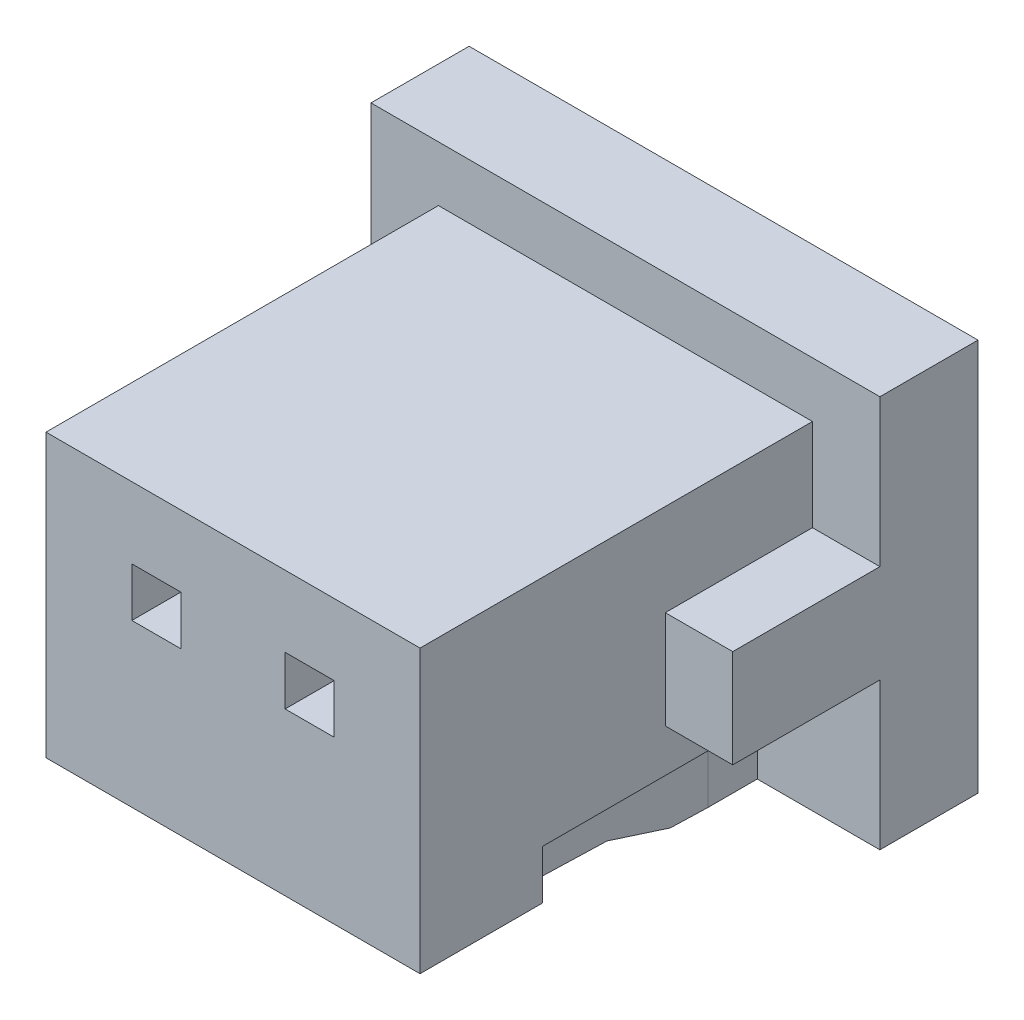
ISO-10303-21;
HEADER;
FILE_DESCRIPTION(('STEP AP214'),'2;1');
FILE_NAME('part.step','',(''),(''),'','','');
FILE_SCHEMA(('AUTOMOTIVE_DESIGN { 1 0 10303 214 1 1 1 1 }'));
ENDSEC;
DATA;
#1=APPLICATION_CONTEXT('core data for automotive mechanical design processes');
#2=APPLICATION_PROTOCOL_DEFINITION('international standard','automotive_design',2000,#1);
#3=PRODUCT_CONTEXT('',#1,'mechanical');
#4=PRODUCT('Part','Part','',(#3));
#5=PRODUCT_RELATED_PRODUCT_CATEGORY('part','',(#4));
#6=PRODUCT_DEFINITION_FORMATION('','',#4);
#7=PRODUCT_DEFINITION_CONTEXT('part definition',#1,'design');
#8=PRODUCT_DEFINITION('design','',#6,#7);
#9=PRODUCT_DEFINITION_SHAPE('','',#8);
#10=(LENGTH_UNIT() NAMED_UNIT(*) SI_UNIT(.MILLI.,.METRE.));
#11=(NAMED_UNIT(*) PLANE_ANGLE_UNIT() SI_UNIT($,.RADIAN.));
#12=(NAMED_UNIT(*) SI_UNIT($,.STERADIAN.) SOLID_ANGLE_UNIT());
#13=UNCERTAINTY_MEASURE_WITH_UNIT(LENGTH_MEASURE(1.E-05),#10,'distance_accuracy_value','');
#14=(GEOMETRIC_REPRESENTATION_CONTEXT(3) GLOBAL_UNCERTAINTY_ASSIGNED_CONTEXT((#13)) GLOBAL_UNIT_ASSIGNED_CONTEXT((#10,
#11,#12)) REPRESENTATION_CONTEXT('',''));
#15=CARTESIAN_POINT('',(0.,0.,0.));
#16=DIRECTION('',(0.,0.,1.));
#17=DIRECTION('',(1.,0.,0.));
#18=AXIS2_PLACEMENT_3D('',#15,#16,#17);
#19=CARTESIAN_POINT('',(0.993913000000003,-6.237301,0.));
#20=DIRECTION('',(0.,1.,0.));
#21=DIRECTION('',(0.,0.,1.));
#22=AXIS2_PLACEMENT_3D('',#19,#20,#21);
#23=PLANE('',#22);
#24=DIRECTION('',(1.,0.,0.));
#25=VECTOR('',#24,1.);
#26=CARTESIAN_POINT('',(1.543913,-6.237301,1.8));
#27=LINE('',#26,#25);
#28=CARTESIAN_POINT('',(1.543913,-6.237301,1.8));
#29=VERTEX_POINT('',#28);
#30=CARTESIAN_POINT('',(0.993913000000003,-6.237301,1.8));
#31=VERTEX_POINT('',#30);
#32=EDGE_CURVE('E452',#29,#31,#27,.F.);
#33=ORIENTED_EDGE('',*,*,#32,.F.);
#34=DIRECTION('',(0.,0.,1.));
#35=VECTOR('',#34,1.);
#36=CARTESIAN_POINT('',(1.543913,-6.237301,1.58195639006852));
#37=LINE('',#36,#35);
#38=CARTESIAN_POINT('',(1.543913,-6.237301,0.));
#39=VERTEX_POINT('',#38);
#40=EDGE_CURVE('E438',#39,#29,#37,.T.);
#41=ORIENTED_EDGE('',*,*,#40,.F.);
#42=DIRECTION('',(1.,0.,0.));
#43=VECTOR('',#42,1.);
#44=CARTESIAN_POINT('',(0.993913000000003,-6.237301,0.));
#45=LINE('',#44,#43);
#46=CARTESIAN_POINT('',(0.993913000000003,-6.237301,0.));
#47=VERTEX_POINT('',#46);
#48=EDGE_CURVE('E19',#39,#47,#45,.F.);
#49=ORIENTED_EDGE('',*,*,#48,.T.);
#50=DIRECTION('',(0.,0.,1.));
#51=VECTOR('',#50,1.);
#52=CARTESIAN_POINT('',(0.993913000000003,-6.237301,1.58195639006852));
#53=LINE('',#52,#51);
#54=EDGE_CURVE('E470',#47,#31,#53,.T.);
#55=ORIENTED_EDGE('',*,*,#54,.T.);
#56=EDGE_LOOP('',(#33,#41,#49,#55));
#57=FACE_BOUND('',#56,.T.);
#58=ADVANCED_FACE('F16',(#57),#23,.T.);
#59=CARTESIAN_POINT('',(1.543913,-6.11797896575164,1.58195639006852));
#60=DIRECTION('',(-1.,0.,0.));
#61=DIRECTION('',(0.,0.,1.));
#62=AXIS2_PLACEMENT_3D('',#59,#60,#61);
#63=PLANE('',#62);
#64=DIRECTION('',(0.,0.573462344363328,0.81923192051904));
#65=VECTOR('',#64,1.);
#66=CARTESIAN_POINT('',(1.543913,-6.237301,1.8));
#67=LINE('',#66,#65);
#68=CARTESIAN_POINT('',(1.543913,-5.887301,2.3));
#69=VERTEX_POINT('',#68);
#70=EDGE_CURVE('E455',#69,#29,#67,.F.);
#71=ORIENTED_EDGE('',*,*,#70,.F.);
#72=DIRECTION('',(0.,0.,1.));
#73=VECTOR('',#72,1.);
#74=CARTESIAN_POINT('',(1.543913,-5.887301,3.6));
#75=LINE('',#74,#73);
#76=CARTESIAN_POINT('',(1.543913,-5.887301,0.));
#77=VERTEX_POINT('',#76);
#78=EDGE_CURVE('E459',#77,#69,#75,.T.);
#79=ORIENTED_EDGE('',*,*,#78,.F.);
#80=DIRECTION('',(0.,1.,0.));
#81=VECTOR('',#80,1.);
#82=CARTESIAN_POINT('',(1.543913,-6.11797896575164,0.));
#83=LINE('',#82,#81);
#84=EDGE_CURVE('E444',#77,#39,#83,.F.);
#85=ORIENTED_EDGE('',*,*,#84,.T.);
#86=ORIENTED_EDGE('',*,*,#40,.T.);
#87=EDGE_LOOP('',(#71,#79,#85,#86));
#88=FACE_BOUND('',#87,.T.);
#89=ADVANCED_FACE('F457',(#88),#63,.T.);
#90=CARTESIAN_POINT('',(1.543913,-6.237301,1.8));
#91=DIRECTION('',(0.,0.81923192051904,-0.573462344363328));
#92=DIRECTION('',(0.,0.573462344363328,0.81923192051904));
#93=AXIS2_PLACEMENT_3D('',#90,#91,#92);
#94=PLANE('',#93);
#95=DIRECTION('',(0.,0.573462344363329,0.81923192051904));
#96=VECTOR('',#95,1.);
#97=CARTESIAN_POINT('',(0.993913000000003,-6.237301,1.8));
#98=LINE('',#97,#96);
#99=CARTESIAN_POINT('',(0.993913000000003,-5.887301,2.3));
#100=VERTEX_POINT('',#99);
#101=EDGE_CURVE('E473',#31,#100,#98,.T.);
#102=ORIENTED_EDGE('',*,*,#101,.T.);
#103=DIRECTION('',(1.,0.,0.));
#104=VECTOR('',#103,1.);
#105=CARTESIAN_POINT('',(1.268913,-5.887301,2.3));
#106=LINE('',#105,#104);
#107=EDGE_CURVE('E480',#69,#100,#106,.F.);
#108=ORIENTED_EDGE('',*,*,#107,.F.);
#109=ORIENTED_EDGE('',*,*,#70,.T.);
#110=ORIENTED_EDGE('',*,*,#32,.T.);
#111=EDGE_LOOP('',(#102,#108,#109,#110));
#112=FACE_BOUND('',#111,.T.);
#113=ADVANCED_FACE('F2152',(#112),#94,.T.);
#114=CARTESIAN_POINT('',(0.993913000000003,-6.11797896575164,1.58195639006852));
#115=DIRECTION('',(-1.,0.,0.));
#116=DIRECTION('',(0.,0.,1.));
#117=AXIS2_PLACEMENT_3D('',#114,#115,#116);
#118=PLANE('',#117);
#119=ORIENTED_EDGE('',*,*,#54,.F.);
#120=DIRECTION('',(0.,1.,0.));
#121=VECTOR('',#120,1.);
#122=CARTESIAN_POINT('',(0.993913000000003,-6.11797896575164,0.));
#123=LINE('',#122,#121);
#124=CARTESIAN_POINT('',(0.993913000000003,-5.887301,0.));
#125=VERTEX_POINT('',#124);
#126=EDGE_CURVE('E447',#125,#47,#123,.F.);
#127=ORIENTED_EDGE('',*,*,#126,.F.);
#128=DIRECTION('',(0.,0.,1.));
#129=VECTOR('',#128,1.);
#130=CARTESIAN_POINT('',(0.993913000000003,-5.887301,3.6));
#131=LINE('',#130,#129);
#132=EDGE_CURVE('E484',#100,#125,#131,.F.);
#133=ORIENTED_EDGE('',*,*,#132,.F.);
#134=ORIENTED_EDGE('',*,*,#101,.F.);
#135=EDGE_LOOP('',(#119,#127,#133,#134));
#136=FACE_BOUND('',#135,.T.);
#137=ADVANCED_FACE('F2140',(#136),#118,.F.);
#138=CARTESIAN_POINT('',(1.268913,-5.887301,3.6));
#139=DIRECTION('',(0.,1.,0.));
#140=DIRECTION('',(0.,0.,1.));
#141=AXIS2_PLACEMENT_3D('',#138,#139,#140);
#142=PLANE('',#141);
#143=DIRECTION('',(0.,0.,1.));
#144=VECTOR('',#143,1.);
#145=CARTESIAN_POINT('',(0.768913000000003,-5.887301,2.42904568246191));
#146=LINE('',#145,#144);
#147=CARTESIAN_POINT('',(0.768913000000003,-5.887301,0.));
#148=VERTEX_POINT('',#147);
#149=CARTESIAN_POINT('',(0.768913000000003,-5.887301,0.8));
#150=VERTEX_POINT('',#149);
#151=EDGE_CURVE('E844',#148,#150,#146,.T.);
#152=ORIENTED_EDGE('',*,*,#151,.T.);
#153=DIRECTION('',(1.,0.,0.));
#154=VECTOR('',#153,1.);
#155=CARTESIAN_POINT('',(0.174325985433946,-5.887301,0.8));
#156=LINE('',#155,#154);
#157=CARTESIAN_POINT('',(0.818913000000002,-5.887301,0.8));
#158=VERTEX_POINT('',#157);
#159=EDGE_CURVE('E935',#158,#150,#156,.F.);
#160=ORIENTED_EDGE('',*,*,#159,.F.);
#161=DIRECTION('',(0.,0.,-1.));
#162=VECTOR('',#161,1.);
#163=CARTESIAN_POINT('',(0.818913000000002,-5.887301,3.03375049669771));
#164=LINE('',#163,#162);
#165=CARTESIAN_POINT('',(0.818912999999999,-5.887301,1.19999999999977));
#166=VERTEX_POINT('',#165);
#167=EDGE_CURVE('E924',#158,#166,#164,.F.);
#168=ORIENTED_EDGE('',*,*,#167,.T.);
#169=DIRECTION('',(0.0312347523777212,0.,0.999512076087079));
#170=VECTOR('',#169,1.);
#171=CARTESIAN_POINT('',(0.818913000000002,-5.887301,1.2));
#172=LINE('',#171,#170);
#173=CARTESIAN_POINT('',(0.868913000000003,-5.887301,2.8));
#174=VERTEX_POINT('',#173);
#175=EDGE_CURVE('E731',#174,#166,#172,.F.);
#176=ORIENTED_EDGE('',*,*,#175,.F.);
#177=DIRECTION('',(1.,0.,0.));
#178=VECTOR('',#177,1.);
#179=CARTESIAN_POINT('',(1.268913,-5.887301,2.8));
#180=LINE('',#179,#178);
#181=CARTESIAN_POINT('',(1.668913,-5.887301,2.8));
#182=VERTEX_POINT('',#181);
#183=EDGE_CURVE('E594',#174,#182,#180,.T.);
#184=ORIENTED_EDGE('',*,*,#183,.T.);
#185=DIRECTION('',(0.0312347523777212,0.,-0.999512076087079));
#186=VECTOR('',#185,1.);
#187=CARTESIAN_POINT('',(1.668913,-5.887301,2.8));
#188=LINE('',#187,#186);
#189=CARTESIAN_POINT('',(1.718913,-5.887301,1.2));
#190=VERTEX_POINT('',#189);
#191=EDGE_CURVE('E697',#190,#182,#188,.F.);
#192=ORIENTED_EDGE('',*,*,#191,.F.);
#193=DIRECTION('',(1.,0.,0.));
#194=VECTOR('',#193,1.);
#195=CARTESIAN_POINT('',(1.893913,-5.887301,1.2));
#196=LINE('',#195,#194);
#197=CARTESIAN_POINT('',(1.768913,-5.887301,1.2));
#198=VERTEX_POINT('',#197);
#199=EDGE_CURVE('E909',#190,#198,#196,.T.);
#200=ORIENTED_EDGE('',*,*,#199,.T.);
#201=DIRECTION('',(0.,0.,1.));
#202=VECTOR('',#201,1.);
#203=CARTESIAN_POINT('',(1.768913,-5.887301,2.42904568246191));
#204=LINE('',#203,#202);
#205=CARTESIAN_POINT('',(1.768913,-5.887301,0.));
#206=VERTEX_POINT('',#205);
#207=EDGE_CURVE('E1164',#206,#198,#204,.T.);
#208=ORIENTED_EDGE('',*,*,#207,.F.);
#209=DIRECTION('',(1.,0.,0.));
#210=VECTOR('',#209,1.);
#211=CARTESIAN_POINT('',(1.268913,-5.887301,0.));
#212=LINE('',#211,#210);
#213=EDGE_CURVE('E34',#206,#77,#212,.F.);
#214=ORIENTED_EDGE('',*,*,#213,.T.);
#215=ORIENTED_EDGE('',*,*,#78,.T.);
#216=ORIENTED_EDGE('',*,*,#107,.T.);
#217=ORIENTED_EDGE('',*,*,#132,.T.);
#218=DIRECTION('',(1.,0.,0.));
#219=VECTOR('',#218,1.);
#220=CARTESIAN_POINT('',(1.268913,-5.887301,0.));
#221=LINE('',#220,#219);
#222=EDGE_CURVE('E488',#125,#148,#221,.F.);
#223=ORIENTED_EDGE('',*,*,#222,.T.);
#224=EDGE_LOOP('',(#152,#160,#168,#176,#184,#192,#200,#208,#214,#215,#216,#217,#223));
#225=FACE_BOUND('',#224,.T.);
#226=ADVANCED_FACE('F2128',(#225),#142,.T.);
#227=CARTESIAN_POINT('',(2.793913,-6.237301,0.));
#228=DIRECTION('',(0.,-1.,0.));
#229=DIRECTION('',(0.,0.,-1.));
#230=AXIS2_PLACEMENT_3D('',#227,#228,#229);
#231=PLANE('',#230);
#232=DIRECTION('',(1.,0.,0.));
#233=VECTOR('',#232,1.);
#234=CARTESIAN_POINT('',(2.243913,-6.237301,1.8));
#235=LINE('',#234,#233);
#236=CARTESIAN_POINT('',(2.243913,-6.237301,1.8));
#237=VERTEX_POINT('',#236);
#238=CARTESIAN_POINT('',(2.793913,-6.237301,1.8));
#239=VERTEX_POINT('',#238);
#240=EDGE_CURVE('E504',#237,#239,#235,.T.);
#241=ORIENTED_EDGE('',*,*,#240,.T.);
#242=DIRECTION('',(0.,0.,1.));
#243=VECTOR('',#242,1.);
#244=CARTESIAN_POINT('',(2.793913,-6.237301,1.58195639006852));
#245=LINE('',#244,#243);
#246=CARTESIAN_POINT('',(2.793913,-6.237301,0.));
#247=VERTEX_POINT('',#246);
#248=EDGE_CURVE('E511',#247,#239,#245,.T.);
#249=ORIENTED_EDGE('',*,*,#248,.F.);
#250=DIRECTION('',(1.,0.,0.));
#251=VECTOR('',#250,1.);
#252=CARTESIAN_POINT('',(2.793913,-6.237301,0.));
#253=LINE('',#252,#251);
#254=CARTESIAN_POINT('',(2.243913,-6.237301,0.));
#255=VERTEX_POINT('',#254);
#256=EDGE_CURVE('E491',#255,#247,#253,.T.);
#257=ORIENTED_EDGE('',*,*,#256,.F.);
#258=DIRECTION('',(0.,0.,1.));
#259=VECTOR('',#258,1.);
#260=CARTESIAN_POINT('',(2.243913,-6.237301,1.58195639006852));
#261=LINE('',#260,#259);
#262=EDGE_CURVE('E497',#255,#237,#261,.T.);
#263=ORIENTED_EDGE('',*,*,#262,.T.);
#264=EDGE_LOOP('',(#241,#249,#257,#263));
#265=FACE_BOUND('',#264,.T.);
#266=ADVANCED_FACE('F2116',(#265),#231,.F.);
#267=CARTESIAN_POINT('',(2.243913,-6.11797896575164,1.58195639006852));
#268=DIRECTION('',(-1.,0.,0.));
#269=DIRECTION('',(0.,0.,1.));
#270=AXIS2_PLACEMENT_3D('',#267,#268,#269);
#271=PLANE('',#270);
#272=DIRECTION('',(0.,-0.573462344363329,-0.81923192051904));
#273=VECTOR('',#272,1.);
#274=CARTESIAN_POINT('',(2.243913,-6.237301,1.8));
#275=LINE('',#274,#273);
#276=CARTESIAN_POINT('',(2.243913,-5.887301,2.3));
#277=VERTEX_POINT('',#276);
#278=EDGE_CURVE('E500',#277,#237,#275,.T.);
#279=ORIENTED_EDGE('',*,*,#278,.T.);
#280=ORIENTED_EDGE('',*,*,#262,.F.);
#281=DIRECTION('',(0.,1.,0.));
#282=VECTOR('',#281,1.);
#283=CARTESIAN_POINT('',(2.243913,-6.11797896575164,0.));
#284=LINE('',#283,#282);
#285=CARTESIAN_POINT('',(2.243913,-5.887301,0.));
#286=VERTEX_POINT('',#285);
#287=EDGE_CURVE('E494',#286,#255,#284,.F.);
#288=ORIENTED_EDGE('',*,*,#287,.F.);
#289=DIRECTION('',(0.,0.,-1.));
#290=VECTOR('',#289,1.);
#291=CARTESIAN_POINT('',(2.243913,-5.887301,3.6));
#292=LINE('',#291,#290);
#293=EDGE_CURVE('E571',#286,#277,#292,.F.);
#294=ORIENTED_EDGE('',*,*,#293,.T.);
#295=EDGE_LOOP('',(#279,#280,#288,#294));
#296=FACE_BOUND('',#295,.T.);
#297=ADVANCED_FACE('F2104',(#296),#271,.F.);
#298=CARTESIAN_POINT('',(2.243913,-6.237301,1.8));
#299=DIRECTION('',(0.,-0.81923192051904,0.573462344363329));
#300=DIRECTION('',(0.,-0.573462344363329,-0.81923192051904));
#301=AXIS2_PLACEMENT_3D('',#298,#299,#300);
#302=PLANE('',#301);
#303=DIRECTION('',(0.,0.573462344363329,0.81923192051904));
#304=VECTOR('',#303,1.);
#305=CARTESIAN_POINT('',(2.793913,-6.237301,1.8));
#306=LINE('',#305,#304);
#307=CARTESIAN_POINT('',(2.793913,-5.887301,2.3));
#308=VERTEX_POINT('',#307);
#309=EDGE_CURVE('E515',#239,#308,#306,.T.);
#310=ORIENTED_EDGE('',*,*,#309,.F.);
#311=ORIENTED_EDGE('',*,*,#240,.F.);
#312=ORIENTED_EDGE('',*,*,#278,.F.);
#313=DIRECTION('',(1.,0.,0.));
#314=VECTOR('',#313,1.);
#315=CARTESIAN_POINT('',(2.518913,-5.887301,2.3));
#316=LINE('',#315,#314);
#317=EDGE_CURVE('E574',#277,#308,#316,.T.);
#318=ORIENTED_EDGE('',*,*,#317,.T.);
#319=EDGE_LOOP('',(#310,#311,#312,#318));
#320=FACE_BOUND('',#319,.T.);
#321=ADVANCED_FACE('F2092',(#320),#302,.F.);
#322=CARTESIAN_POINT('',(2.793913,-6.11797896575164,1.58195639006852));
#323=DIRECTION('',(-1.,0.,0.));
#324=DIRECTION('',(0.,0.,1.));
#325=AXIS2_PLACEMENT_3D('',#322,#323,#324);
#326=PLANE('',#325);
#327=ORIENTED_EDGE('',*,*,#248,.T.);
#328=ORIENTED_EDGE('',*,*,#309,.T.);
#329=DIRECTION('',(0.,0.,-1.));
#330=VECTOR('',#329,1.);
#331=CARTESIAN_POINT('',(2.793913,-5.887301,3.6));
#332=LINE('',#331,#330);
#333=CARTESIAN_POINT('',(2.793913,-5.887301,0.));
#334=VERTEX_POINT('',#333);
#335=EDGE_CURVE('E577',#308,#334,#332,.T.);
#336=ORIENTED_EDGE('',*,*,#335,.T.);
#337=DIRECTION('',(0.,1.,0.));
#338=VECTOR('',#337,1.);
#339=CARTESIAN_POINT('',(2.793913,-6.11797896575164,0.));
#340=LINE('',#339,#338);
#341=EDGE_CURVE('E507',#334,#247,#340,.F.);
#342=ORIENTED_EDGE('',*,*,#341,.T.);
#343=EDGE_LOOP('',(#327,#328,#336,#342));
#344=FACE_BOUND('',#343,.T.);
#345=ADVANCED_FACE('F2080',(#344),#326,.T.);
#346=CARTESIAN_POINT('',(-5.2735846,-6.287301,3.));
#347=DIRECTION('',(0.,1.,0.));
#348=DIRECTION('',(0.,0.,1.));
#349=AXIS2_PLACEMENT_3D('',#346,#347,#348);
#350=PLANE('',#349);
#351=DIRECTION('',(0.,0.,1.));
#352=VECTOR('',#351,1.);
#353=CARTESIAN_POINT('',(2.293913,-6.287301,3.));
#354=LINE('',#353,#352);
#355=CARTESIAN_POINT('',(2.293913,-6.287301,3.4));
#356=VERTEX_POINT('',#355);
#357=CARTESIAN_POINT('',(2.293913,-6.287301,3.));
#358=VERTEX_POINT('',#357);
#359=EDGE_CURVE('E531',#356,#358,#354,.F.);
#360=ORIENTED_EDGE('',*,*,#359,.F.);
#361=DIRECTION('',(1.,0.,0.));
#362=VECTOR('',#361,1.);
#363=CARTESIAN_POINT('',(2.518913,-6.287301,3.4));
#364=LINE('',#363,#362);
#365=CARTESIAN_POINT('',(2.743913,-6.287301,3.4));
#366=VERTEX_POINT('',#365);
#367=EDGE_CURVE('E619',#356,#366,#364,.T.);
#368=ORIENTED_EDGE('',*,*,#367,.T.);
#369=DIRECTION('',(0.,0.,1.));
#370=VECTOR('',#369,1.);
#371=CARTESIAN_POINT('',(2.743913,-6.287301,2.42904568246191));
#372=LINE('',#371,#370);
#373=CARTESIAN_POINT('',(2.743913,-6.287301,3.));
#374=VERTEX_POINT('',#373);
#375=EDGE_CURVE('E622',#374,#366,#372,.T.);
#376=ORIENTED_EDGE('',*,*,#375,.F.);
#377=DIRECTION('',(1.,0.,0.));
#378=VECTOR('',#377,1.);
#379=CARTESIAN_POINT('',(1.7689106,-6.287301,3.));
#380=LINE('',#379,#378);
#381=CARTESIAN_POINT('',(3.418913,-6.287301,3.));
#382=VERTEX_POINT('',#381);
#383=EDGE_CURVE('E637',#374,#382,#380,.T.);
#384=ORIENTED_EDGE('',*,*,#383,.T.);
#385=DIRECTION('',(0.,0.,-1.));
#386=VECTOR('',#385,1.);
#387=CARTESIAN_POINT('',(3.418913,-6.287301,1.1));
#388=LINE('',#387,#386);
#389=CARTESIAN_POINT('',(3.418913,-6.287301,4.));
#390=VERTEX_POINT('',#389);
#391=EDGE_CURVE('E597',#390,#382,#388,.T.);
#392=ORIENTED_EDGE('',*,*,#391,.F.);
#393=DIRECTION('',(1.,0.,0.));
#394=VECTOR('',#393,1.);
#395=CARTESIAN_POINT('',(1.31226892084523,-6.287301,4.));
#396=LINE('',#395,#394);
#397=CARTESIAN_POINT('',(0.368913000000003,-6.287301,4.));
#398=VERTEX_POINT('',#397);
#399=EDGE_CURVE('E641',#398,#390,#396,.T.);
#400=ORIENTED_EDGE('',*,*,#399,.F.);
#401=DIRECTION('',(0.,0.,-1.));
#402=VECTOR('',#401,1.);
#403=CARTESIAN_POINT('',(0.368913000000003,-6.287301,1.1));
#404=LINE('',#403,#402);
#405=CARTESIAN_POINT('',(0.368913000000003,-6.287301,3.));
#406=VERTEX_POINT('',#405);
#407=EDGE_CURVE('E537',#398,#406,#404,.T.);
#408=ORIENTED_EDGE('',*,*,#407,.T.);
#409=DIRECTION('',(1.,0.,0.));
#410=VECTOR('',#409,1.);
#411=CARTESIAN_POINT('',(-5.2735846,-6.287301,3.));
#412=LINE('',#411,#410);
#413=CARTESIAN_POINT('',(1.043913,-6.287301,3.));
#414=VERTEX_POINT('',#413);
#415=EDGE_CURVE('E528',#414,#406,#412,.F.);
#416=ORIENTED_EDGE('',*,*,#415,.F.);
#417=DIRECTION('',(0.,0.,1.));
#418=VECTOR('',#417,1.);
#419=CARTESIAN_POINT('',(1.043913,-6.287301,3.));
#420=LINE('',#419,#418);
#421=CARTESIAN_POINT('',(1.043913,-6.287301,3.4));
#422=VERTEX_POINT('',#421);
#423=EDGE_CURVE('E525',#422,#414,#420,.F.);
#424=ORIENTED_EDGE('',*,*,#423,.F.);
#425=DIRECTION('',(1.,0.,0.));
#426=VECTOR('',#425,1.);
#427=CARTESIAN_POINT('',(-5.2735846,-6.287301,3.4));
#428=LINE('',#427,#426);
#429=CARTESIAN_POINT('',(1.493913,-6.287301,3.4));
#430=VERTEX_POINT('',#429);
#431=EDGE_CURVE('E522',#430,#422,#428,.F.);
#432=ORIENTED_EDGE('',*,*,#431,.F.);
#433=DIRECTION('',(0.,0.,1.));
#434=VECTOR('',#433,1.);
#435=CARTESIAN_POINT('',(1.493913,-6.287301,3.));
#436=LINE('',#435,#434);
#437=CARTESIAN_POINT('',(1.493913,-6.287301,3.));
#438=VERTEX_POINT('',#437);
#439=EDGE_CURVE('E519',#438,#430,#436,.T.);
#440=ORIENTED_EDGE('',*,*,#439,.F.);
#441=DIRECTION('',(1.,0.,0.));
#442=VECTOR('',#441,1.);
#443=CARTESIAN_POINT('',(-5.2735846,-6.287301,3.));
#444=LINE('',#443,#442);
#445=EDGE_CURVE('E534',#358,#438,#444,.F.);
#446=ORIENTED_EDGE('',*,*,#445,.F.);
#447=EDGE_LOOP('',(#360,#368,#376,#384,#392,#400,#408,#416,#424,#432,#440,#446));
#448=FACE_BOUND('',#447,.T.);
#449=ADVANCED_FACE('F2068',(#448),#350,.F.);
#450=CARTESIAN_POINT('',(0.368913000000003,-3.98730099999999,1.1));
#451=DIRECTION('',(1.,0.,0.));
#452=DIRECTION('',(0.,0.,-1.));
#453=AXIS2_PLACEMENT_3D('',#450,#451,#452);
#454=PLANE('',#453);
#455=DIRECTION('',(0.,0.,-1.));
#456=VECTOR('',#455,1.);
#457=CARTESIAN_POINT('',(0.368913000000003,-4.737301,1.1));
#458=LINE('',#457,#456);
#459=CARTESIAN_POINT('',(0.368913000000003,-4.737301,2.));
#460=VERTEX_POINT('',#459);
#461=CARTESIAN_POINT('',(0.368913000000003,-4.737301,0.8));
#462=VERTEX_POINT('',#461);
#463=EDGE_CURVE('E553',#460,#462,#458,.T.);
#464=ORIENTED_EDGE('',*,*,#463,.F.);
#465=DIRECTION('',(0.,1.,0.));
#466=VECTOR('',#465,1.);
#467=CARTESIAN_POINT('',(0.368913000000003,-3.98730099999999,2.));
#468=LINE('',#467,#466);
#469=CARTESIAN_POINT('',(0.368913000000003,-5.537301,2.));
#470=VERTEX_POINT('',#469);
#471=EDGE_CURVE('E550',#470,#460,#468,.T.);
#472=ORIENTED_EDGE('',*,*,#471,.F.);
#473=DIRECTION('',(0.,0.,-1.));
#474=VECTOR('',#473,1.);
#475=CARTESIAN_POINT('',(0.368913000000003,-5.537301,1.1));
#476=LINE('',#475,#474);
#477=CARTESIAN_POINT('',(0.368913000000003,-5.537301,0.8));
#478=VERTEX_POINT('',#477);
#479=EDGE_CURVE('E547',#478,#470,#476,.F.);
#480=ORIENTED_EDGE('',*,*,#479,.F.);
#481=DIRECTION('',(0.,1.,0.));
#482=VECTOR('',#481,1.);
#483=CARTESIAN_POINT('',(0.368913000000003,-3.98730099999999,0.8));
#484=LINE('',#483,#482);
#485=CARTESIAN_POINT('',(0.368913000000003,-5.887301,0.8));
#486=VERTEX_POINT('',#485);
#487=EDGE_CURVE('E544',#486,#478,#484,.T.);
#488=ORIENTED_EDGE('',*,*,#487,.F.);
#489=DIRECTION('',(0.,0.,-1.));
#490=VECTOR('',#489,1.);
#491=CARTESIAN_POINT('',(0.368913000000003,-5.887301,3.));
#492=LINE('',#491,#490);
#493=CARTESIAN_POINT('',(0.368913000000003,-5.887301,3.));
#494=VERTEX_POINT('',#493);
#495=EDGE_CURVE('E653',#494,#486,#492,.T.);
#496=ORIENTED_EDGE('',*,*,#495,.F.);
#497=DIRECTION('',(0.,1.,0.));
#498=VECTOR('',#497,1.);
#499=CARTESIAN_POINT('',(0.368913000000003,-3.98730099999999,3.));
#500=LINE('',#499,#498);
#501=EDGE_CURVE('E541',#406,#494,#500,.T.);
#502=ORIENTED_EDGE('',*,*,#501,.F.);
#503=ORIENTED_EDGE('',*,*,#407,.F.);
#504=DIRECTION('',(0.,1.,0.));
#505=VECTOR('',#504,1.);
#506=CARTESIAN_POINT('',(0.368913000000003,-4.19797343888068,4.));
#507=LINE('',#506,#505);
#508=CARTESIAN_POINT('',(0.368913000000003,-3.987301,4.));
#509=VERTEX_POINT('',#508);
#510=EDGE_CURVE('E649',#509,#398,#507,.F.);
#511=ORIENTED_EDGE('',*,*,#510,.F.);
#512=DIRECTION('',(0.,0.,-1.));
#513=VECTOR('',#512,1.);
#514=CARTESIAN_POINT('',(0.368913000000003,-3.987301,3.9));
#515=LINE('',#514,#513);
#516=CARTESIAN_POINT('',(0.368913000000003,-3.98730099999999,0.8));
#517=VERTEX_POINT('',#516);
#518=EDGE_CURVE('E671',#509,#517,#515,.T.);
#519=ORIENTED_EDGE('',*,*,#518,.T.);
#520=DIRECTION('',(0.,1.,0.));
#521=VECTOR('',#520,1.);
#522=CARTESIAN_POINT('',(0.368913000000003,-3.98730099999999,0.8));
#523=LINE('',#522,#521);
#524=EDGE_CURVE('E556',#462,#517,#523,.T.);
#525=ORIENTED_EDGE('',*,*,#524,.F.);
#526=EDGE_LOOP('',(#464,#472,#480,#488,#496,#502,#503,#511,#519,#525));
#527=FACE_BOUND('',#526,.T.);
#528=ADVANCED_FACE('F2057',(#527),#454,.F.);
#529=CARTESIAN_POINT('',(2.518913,-5.887301,3.6));
#530=DIRECTION('',(0.,-1.,0.));
#531=DIRECTION('',(0.,0.,-1.));
#532=AXIS2_PLACEMENT_3D('',#529,#530,#531);
#533=PLANE('',#532);
#534=DIRECTION('',(0.,0.,-1.));
#535=VECTOR('',#534,1.);
#536=CARTESIAN_POINT('',(3.018913,-5.887301,3.6));
#537=LINE('',#536,#535);
#538=CARTESIAN_POINT('',(3.018913,-5.887301,0.));
#539=VERTEX_POINT('',#538);
#540=CARTESIAN_POINT('',(3.018913,-5.887301,0.8));
#541=VERTEX_POINT('',#540);
#542=EDGE_CURVE('E584',#539,#541,#537,.F.);
#543=ORIENTED_EDGE('',*,*,#542,.F.);
#544=DIRECTION('',(1.,0.,0.));
#545=VECTOR('',#544,1.);
#546=CARTESIAN_POINT('',(2.518913,-5.887301,0.));
#547=LINE('',#546,#545);
#548=EDGE_CURVE('E581',#334,#539,#547,.T.);
#549=ORIENTED_EDGE('',*,*,#548,.F.);
#550=ORIENTED_EDGE('',*,*,#335,.F.);
#551=ORIENTED_EDGE('',*,*,#317,.F.);
#552=ORIENTED_EDGE('',*,*,#293,.F.);
#553=DIRECTION('',(1.,0.,0.));
#554=VECTOR('',#553,1.);
#555=CARTESIAN_POINT('',(2.518913,-5.887301,0.));
#556=LINE('',#555,#554);
#557=CARTESIAN_POINT('',(2.018913,-5.887301,0.));
#558=VERTEX_POINT('',#557);
#559=EDGE_CURVE('E568',#558,#286,#556,.T.);
#560=ORIENTED_EDGE('',*,*,#559,.F.);
#561=DIRECTION('',(0.,0.,-1.));
#562=VECTOR('',#561,1.);
#563=CARTESIAN_POINT('',(2.018913,-5.887301,3.6));
#564=LINE('',#563,#562);
#565=CARTESIAN_POINT('',(2.018913,-5.887301,1.2));
#566=VERTEX_POINT('',#565);
#567=EDGE_CURVE('E565',#566,#558,#564,.T.);
#568=ORIENTED_EDGE('',*,*,#567,.F.);
#569=DIRECTION('',(1.,0.,0.));
#570=VECTOR('',#569,1.);
#571=CARTESIAN_POINT('',(2.518913,-5.887301,1.2));
#572=LINE('',#571,#570);
#573=CARTESIAN_POINT('',(2.068913,-5.887301,1.2));
#574=VERTEX_POINT('',#573);
#575=EDGE_CURVE('E562',#574,#566,#572,.F.);
#576=ORIENTED_EDGE('',*,*,#575,.F.);
#577=DIRECTION('',(-0.0312347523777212,0.,-0.999512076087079));
#578=VECTOR('',#577,1.);
#579=CARTESIAN_POINT('',(2.118913,-5.887301,2.8));
#580=LINE('',#579,#578);
#581=CARTESIAN_POINT('',(2.118913,-5.887301,2.8));
#582=VERTEX_POINT('',#581);
#583=EDGE_CURVE('E711',#574,#582,#580,.F.);
#584=ORIENTED_EDGE('',*,*,#583,.T.);
#585=DIRECTION('',(1.,0.,0.));
#586=VECTOR('',#585,1.);
#587=CARTESIAN_POINT('',(2.518913,-5.887301,2.8));
#588=LINE('',#587,#586);
#589=CARTESIAN_POINT('',(2.918913,-5.887301,2.8));
#590=VERTEX_POINT('',#589);
#591=EDGE_CURVE('E590',#590,#582,#588,.F.);
#592=ORIENTED_EDGE('',*,*,#591,.F.);
#593=DIRECTION('',(-0.0312347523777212,0.,0.999512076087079));
#594=VECTOR('',#593,1.);
#595=CARTESIAN_POINT('',(2.968913,-5.887301,1.2));
#596=LINE('',#595,#594);
#597=CARTESIAN_POINT('',(2.968913,-5.887301,1.19999999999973));
#598=VERTEX_POINT('',#597);
#599=EDGE_CURVE('E675',#590,#598,#596,.F.);
#600=ORIENTED_EDGE('',*,*,#599,.T.);
#601=DIRECTION('',(0.,0.,-1.));
#602=VECTOR('',#601,1.);
#603=CARTESIAN_POINT('',(2.968913,-5.887301,3.6));
#604=LINE('',#603,#602);
#605=CARTESIAN_POINT('',(2.968913,-5.887301,0.8));
#606=VERTEX_POINT('',#605);
#607=EDGE_CURVE('E559',#606,#598,#604,.F.);
#608=ORIENTED_EDGE('',*,*,#607,.F.);
#609=DIRECTION('',(1.,0.,0.));
#610=VECTOR('',#609,1.);
#611=CARTESIAN_POINT('',(2.518913,-5.887301,0.8));
#612=LINE('',#611,#610);
#613=EDGE_CURVE('E587',#541,#606,#612,.F.);
#614=ORIENTED_EDGE('',*,*,#613,.F.);
#615=EDGE_LOOP('',(#543,#549,#550,#551,#552,#560,#568,#576,#584,#592,#600,#608,#614));
#616=FACE_BOUND('',#615,.T.);
#617=ADVANCED_FACE('F1222',(#616),#533,.F.);
#618=CARTESIAN_POINT('',(2.518913,-6.287301,2.77142857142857));
#619=DIRECTION('',(0.,-0.0712470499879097,0.997458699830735));
#620=DIRECTION('',(0.,-0.997458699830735,-0.0712470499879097));
#621=AXIS2_PLACEMENT_3D('',#618,#619,#620);
#622=PLANE('',#621);
#623=DIRECTION('',(-0.00222646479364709,0.99745622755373,0.0712468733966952));
#624=VECTOR('',#623,1.);
#625=CARTESIAN_POINT('',(2.9204755,-6.587301,2.75));
#626=LINE('',#625,#624);
#627=CARTESIAN_POINT('',(2.9204755,-6.587301,2.75));
#628=VERTEX_POINT('',#627);
#629=EDGE_CURVE('E685',#628,#590,#626,.T.);
#630=ORIENTED_EDGE('',*,*,#629,.T.);
#631=ORIENTED_EDGE('',*,*,#591,.T.);
#632=DIRECTION('',(-0.00222646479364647,-0.99745622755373,-0.0712468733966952));
#633=VECTOR('',#632,1.);
#634=CARTESIAN_POINT('',(2.118913,-5.887301,2.8));
#635=LINE('',#634,#633);
#636=CARTESIAN_POINT('',(2.1173505,-6.587301,2.75));
#637=VERTEX_POINT('',#636);
#638=EDGE_CURVE('E714',#582,#637,#635,.T.);
#639=ORIENTED_EDGE('',*,*,#638,.T.);
#640=DIRECTION('',(1.,0.,0.));
#641=VECTOR('',#640,1.);
#642=CARTESIAN_POINT('',(2.518913,-6.587301,2.75));
#643=LINE('',#642,#641);
#644=EDGE_CURVE('E693',#628,#637,#643,.F.);
#645=ORIENTED_EDGE('',*,*,#644,.F.);
#646=EDGE_LOOP('',(#630,#631,#639,#645));
#647=FACE_BOUND('',#646,.T.);
#648=ADVANCED_FACE('F1293',(#647),#622,.T.);
#649=CARTESIAN_POINT('',(1.268913,-6.287301,2.77142857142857));
#650=DIRECTION('',(0.,0.0712470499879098,-0.997458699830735));
#651=DIRECTION('',(0.,0.997458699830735,0.0712470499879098));
#652=AXIS2_PLACEMENT_3D('',#649,#650,#651);
#653=PLANE('',#652);
#654=DIRECTION('',(0.00222646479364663,0.99745622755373,0.0712468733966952));
#655=VECTOR('',#654,1.);
#656=CARTESIAN_POINT('',(0.867350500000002,-6.587301,2.75));
#657=LINE('',#656,#655);
#658=CARTESIAN_POINT('',(0.867350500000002,-6.587301,2.75));
#659=VERTEX_POINT('',#658);
#660=EDGE_CURVE('E742',#659,#174,#657,.T.);
#661=ORIENTED_EDGE('',*,*,#660,.F.);
#662=DIRECTION('',(1.,0.,0.));
#663=VECTOR('',#662,1.);
#664=CARTESIAN_POINT('',(1.268913,-6.587301,2.75));
#665=LINE('',#664,#663);
#666=CARTESIAN_POINT('',(1.6704755,-6.587301,2.75));
#667=VERTEX_POINT('',#666);
#668=EDGE_CURVE('E727',#659,#667,#665,.T.);
#669=ORIENTED_EDGE('',*,*,#668,.T.);
#670=DIRECTION('',(0.00222646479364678,-0.99745622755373,-0.0712468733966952));
#671=VECTOR('',#670,1.);
#672=CARTESIAN_POINT('',(1.668913,-5.887301,2.8));
#673=LINE('',#672,#671);
#674=EDGE_CURVE('E701',#182,#667,#673,.T.);
#675=ORIENTED_EDGE('',*,*,#674,.F.);
#676=ORIENTED_EDGE('',*,*,#183,.F.);
#677=EDGE_LOOP('',(#661,#669,#675,#676));
#678=FACE_BOUND('',#677,.T.);
#679=ADVANCED_FACE('F2025',(#678),#653,.F.);
#680=CARTESIAN_POINT('',(3.418913,-3.98730099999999,1.1));
#681=DIRECTION('',(1.,0.,0.));
#682=DIRECTION('',(0.,0.,-1.));
#683=AXIS2_PLACEMENT_3D('',#680,#681,#682);
#684=PLANE('',#683);
#685=DIRECTION('',(0.,0.,-1.));
#686=VECTOR('',#685,1.);
#687=CARTESIAN_POINT('',(3.418913,-4.737301,1.1));
#688=LINE('',#687,#686);
#689=CARTESIAN_POINT('',(3.418913,-4.737301,2.));
#690=VERTEX_POINT('',#689);
#691=CARTESIAN_POINT('',(3.418913,-4.737301,0.8));
#692=VERTEX_POINT('',#691);
#693=EDGE_CURVE('E612',#690,#692,#688,.T.);
#694=ORIENTED_EDGE('',*,*,#693,.T.);
#695=DIRECTION('',(0.,1.,0.));
#696=VECTOR('',#695,1.);
#697=CARTESIAN_POINT('',(3.418913,-3.98730099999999,0.8));
#698=LINE('',#697,#696);
#699=CARTESIAN_POINT('',(3.418913,-3.98730099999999,0.8));
#700=VERTEX_POINT('',#699);
#701=EDGE_CURVE('E616',#692,#700,#698,.T.);
#702=ORIENTED_EDGE('',*,*,#701,.T.);
#703=DIRECTION('',(0.,0.,-1.));
#704=VECTOR('',#703,1.);
#705=CARTESIAN_POINT('',(3.418913,-3.987301,3.9));
#706=LINE('',#705,#704);
#707=CARTESIAN_POINT('',(3.418913,-3.987301,4.));
#708=VERTEX_POINT('',#707);
#709=EDGE_CURVE('E664',#700,#708,#706,.F.);
#710=ORIENTED_EDGE('',*,*,#709,.T.);
#711=DIRECTION('',(0.,1.,0.));
#712=VECTOR('',#711,1.);
#713=CARTESIAN_POINT('',(3.418913,-4.19797343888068,4.));
#714=LINE('',#713,#712);
#715=EDGE_CURVE('E645',#390,#708,#714,.T.);
#716=ORIENTED_EDGE('',*,*,#715,.F.);
#717=ORIENTED_EDGE('',*,*,#391,.T.);
#718=DIRECTION('',(0.,-1.,0.));
#719=VECTOR('',#718,1.);
#720=CARTESIAN_POINT('',(3.418913,-6.287301,3.));
#721=LINE('',#720,#719);
#722=CARTESIAN_POINT('',(3.418913,-5.887301,3.));
#723=VERTEX_POINT('',#722);
#724=EDGE_CURVE('E630',#382,#723,#721,.F.);
#725=ORIENTED_EDGE('',*,*,#724,.T.);
#726=DIRECTION('',(0.,0.,1.));
#727=VECTOR('',#726,1.);
#728=CARTESIAN_POINT('',(3.418913,-5.887301,3.));
#729=LINE('',#728,#727);
#730=CARTESIAN_POINT('',(3.418913,-5.887301,0.8));
#731=VERTEX_POINT('',#730);
#732=EDGE_CURVE('E750',#723,#731,#729,.F.);
#733=ORIENTED_EDGE('',*,*,#732,.T.);
#734=DIRECTION('',(0.,1.,0.));
#735=VECTOR('',#734,1.);
#736=CARTESIAN_POINT('',(3.418913,-3.98730099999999,0.8));
#737=LINE('',#736,#735);
#738=CARTESIAN_POINT('',(3.418913,-5.537301,0.8));
#739=VERTEX_POINT('',#738);
#740=EDGE_CURVE('E600',#731,#739,#737,.T.);
#741=ORIENTED_EDGE('',*,*,#740,.T.);
#742=DIRECTION('',(0.,0.,-1.));
#743=VECTOR('',#742,1.);
#744=CARTESIAN_POINT('',(3.418913,-5.537301,1.1));
#745=LINE('',#744,#743);
#746=CARTESIAN_POINT('',(3.418913,-5.537301,2.));
#747=VERTEX_POINT('',#746);
#748=EDGE_CURVE('E604',#739,#747,#745,.F.);
#749=ORIENTED_EDGE('',*,*,#748,.T.);
#750=DIRECTION('',(0.,1.,0.));
#751=VECTOR('',#750,1.);
#752=CARTESIAN_POINT('',(3.418913,-3.98730099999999,2.));
#753=LINE('',#752,#751);
#754=EDGE_CURVE('E608',#747,#690,#753,.T.);
#755=ORIENTED_EDGE('',*,*,#754,.T.);
#756=EDGE_LOOP('',(#694,#702,#710,#716,#717,#725,#733,#741,#749,#755));
#757=FACE_BOUND('',#756,.T.);
#758=ADVANCED_FACE('F1247',(#757),#684,.T.);
#759=CARTESIAN_POINT('',(2.518913,-6.287301,3.4));
#760=DIRECTION('',(0.,0.,1.));
#761=DIRECTION('',(0.,-1.,0.));
#762=AXIS2_PLACEMENT_3D('',#759,#760,#761);
#763=PLANE('',#762);
#764=DIRECTION('',(1.,0.,0.));
#765=VECTOR('',#764,1.);
#766=CARTESIAN_POINT('',(2.518913,-5.887301,3.4));
#767=LINE('',#766,#765);
#768=CARTESIAN_POINT('',(2.293913,-5.887301,3.4));
#769=VERTEX_POINT('',#768);
#770=CARTESIAN_POINT('',(2.743913,-5.887301,3.4));
#771=VERTEX_POINT('',#770);
#772=EDGE_CURVE('E758',#769,#771,#767,.T.);
#773=ORIENTED_EDGE('',*,*,#772,.T.);
#774=DIRECTION('',(0.,1.,0.));
#775=VECTOR('',#774,1.);
#776=CARTESIAN_POINT('',(2.743913,-5.59778542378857,3.4));
#777=LINE('',#776,#775);
#778=EDGE_CURVE('E626',#366,#771,#777,.T.);
#779=ORIENTED_EDGE('',*,*,#778,.F.);
#780=ORIENTED_EDGE('',*,*,#367,.F.);
#781=DIRECTION('',(0.,1.,0.));
#782=VECTOR('',#781,1.);
#783=CARTESIAN_POINT('',(2.293913,-5.59778542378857,3.4));
#784=LINE('',#783,#782);
#785=EDGE_CURVE('E661',#356,#769,#784,.T.);
#786=ORIENTED_EDGE('',*,*,#785,.T.);
#787=EDGE_LOOP('',(#773,#779,#780,#786));
#788=FACE_BOUND('',#787,.T.);
#789=ADVANCED_FACE('F1262',(#788),#763,.F.);
#790=CARTESIAN_POINT('',(2.743913,-5.59778542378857,2.42904568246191));
#791=DIRECTION('',(-1.,0.,0.));
#792=DIRECTION('',(0.,0.,1.));
#793=AXIS2_PLACEMENT_3D('',#790,#791,#792);
#794=PLANE('',#793);
#795=DIRECTION('',(0.,0.,-1.));
#796=VECTOR('',#795,1.);
#797=CARTESIAN_POINT('',(2.743913,-5.887301,3.6));
#798=LINE('',#797,#796);
#799=CARTESIAN_POINT('',(2.743913,-5.887301,3.));
#800=VERTEX_POINT('',#799);
#801=EDGE_CURVE('E761',#771,#800,#798,.T.);
#802=ORIENTED_EDGE('',*,*,#801,.T.);
#803=DIRECTION('',(0.,-1.,0.));
#804=VECTOR('',#803,1.);
#805=CARTESIAN_POINT('',(2.743913,-6.287301,3.));
#806=LINE('',#805,#804);
#807=EDGE_CURVE('E633',#800,#374,#806,.T.);
#808=ORIENTED_EDGE('',*,*,#807,.T.);
#809=ORIENTED_EDGE('',*,*,#375,.T.);
#810=ORIENTED_EDGE('',*,*,#778,.T.);
#811=EDGE_LOOP('',(#802,#808,#809,#810));
#812=FACE_BOUND('',#811,.T.);
#813=ADVANCED_FACE('F1258',(#812),#794,.T.);
#814=CARTESIAN_POINT('',(1.7689106,-6.287301,3.));
#815=DIRECTION('',(0.,0.,1.));
#816=DIRECTION('',(0.,-1.,0.));
#817=AXIS2_PLACEMENT_3D('',#814,#815,#816);
#818=PLANE('',#817);
#819=ORIENTED_EDGE('',*,*,#807,.F.);
#820=DIRECTION('',(1.,0.,0.));
#821=VECTOR('',#820,1.);
#822=CARTESIAN_POINT('',(2.518913,-5.887301,3.));
#823=LINE('',#822,#821);
#824=CARTESIAN_POINT('',(3.018913,-5.887301,3.));
#825=VERTEX_POINT('',#824);
#826=EDGE_CURVE('E764',#800,#825,#823,.T.);
#827=ORIENTED_EDGE('',*,*,#826,.T.);
#828=DIRECTION('',(1.,0.,0.));
#829=VECTOR('',#828,1.);
#830=CARTESIAN_POINT('',(1.7689106,-5.887301,3.));
#831=LINE('',#830,#829);
#832=EDGE_CURVE('E746',#825,#723,#831,.T.);
#833=ORIENTED_EDGE('',*,*,#832,.T.);
#834=ORIENTED_EDGE('',*,*,#724,.F.);
#835=ORIENTED_EDGE('',*,*,#383,.F.);
#836=EDGE_LOOP('',(#819,#827,#833,#834,#835));
#837=FACE_BOUND('',#836,.T.);
#838=ADVANCED_FACE('F1253',(#837),#818,.F.);
#839=CARTESIAN_POINT('',(1.31226892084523,-4.19797343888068,4.));
#840=DIRECTION('',(0.,0.,1.));
#841=DIRECTION('',(1.,0.,0.));
#842=AXIS2_PLACEMENT_3D('',#839,#840,#841);
#843=PLANE('',#842);
#844=DIRECTION('',(0.,1.,0.));
#845=VECTOR('',#844,1.);
#846=CARTESIAN_POINT('',(2.718913,-4.967301,4.));
#847=LINE('',#846,#845);
#848=CARTESIAN_POINT('',(2.718913,-4.567301,4.));
#849=VERTEX_POINT('',#848);
#850=CARTESIAN_POINT('',(2.718913,-4.967301,4.));
#851=VERTEX_POINT('',#850);
#852=EDGE_CURVE('E767',#849,#851,#847,.F.);
#853=ORIENTED_EDGE('',*,*,#852,.T.);
#854=DIRECTION('',(1.,0.,0.));
#855=VECTOR('',#854,1.);
#856=CARTESIAN_POINT('',(2.318913,-4.967301,4.));
#857=LINE('',#856,#855);
#858=CARTESIAN_POINT('',(2.318913,-4.967301,4.));
#859=VERTEX_POINT('',#858);
#860=EDGE_CURVE('E774',#851,#859,#857,.F.);
#861=ORIENTED_EDGE('',*,*,#860,.T.);
#862=DIRECTION('',(0.,1.,0.));
#863=VECTOR('',#862,1.);
#864=CARTESIAN_POINT('',(2.318913,-4.567301,4.));
#865=LINE('',#864,#863);
#866=CARTESIAN_POINT('',(2.318913,-4.567301,4.));
#867=VERTEX_POINT('',#866);
#868=EDGE_CURVE('E777',#859,#867,#865,.T.);
#869=ORIENTED_EDGE('',*,*,#868,.T.);
#870=DIRECTION('',(1.,0.,0.));
#871=VECTOR('',#870,1.);
#872=CARTESIAN_POINT('',(2.718913,-4.567301,4.));
#873=LINE('',#872,#871);
#874=EDGE_CURVE('E791',#867,#849,#873,.T.);
#875=ORIENTED_EDGE('',*,*,#874,.T.);
#876=EDGE_LOOP('',(#853,#861,#869,#875));
#877=FACE_BOUND('',#876,.T.);
#878=DIRECTION('',(1.,0.,0.));
#879=VECTOR('',#878,1.);
#880=CARTESIAN_POINT('',(3.143913,-3.987301,4.));
#881=LINE('',#880,#879);
#882=EDGE_CURVE('E667',#708,#509,#881,.F.);
#883=ORIENTED_EDGE('',*,*,#882,.T.);
#884=ORIENTED_EDGE('',*,*,#510,.T.);
#885=ORIENTED_EDGE('',*,*,#399,.T.);
#886=ORIENTED_EDGE('',*,*,#715,.T.);
#887=EDGE_LOOP('',(#883,#884,#885,#886));
#888=FACE_BOUND('',#887,.T.);
#889=DIRECTION('',(1.,0.,0.));
#890=VECTOR('',#889,1.);
#891=CARTESIAN_POINT('',(1.068913,-4.567301,4.));
#892=LINE('',#891,#890);
#893=CARTESIAN_POINT('',(1.468913,-4.567301,4.));
#894=VERTEX_POINT('',#893);
#895=CARTESIAN_POINT('',(1.068913,-4.567301,4.));
#896=VERTEX_POINT('',#895);
#897=EDGE_CURVE('E836',#894,#896,#892,.F.);
#898=ORIENTED_EDGE('',*,*,#897,.F.);
#899=DIRECTION('',(0.,1.,0.));
#900=VECTOR('',#899,1.);
#901=CARTESIAN_POINT('',(1.46891300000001,-4.567301,4.));
#902=LINE('',#901,#900);
#903=CARTESIAN_POINT('',(1.468913,-4.967301,4.));
#904=VERTEX_POINT('',#903);
#905=EDGE_CURVE('E821',#904,#894,#902,.T.);
#906=ORIENTED_EDGE('',*,*,#905,.F.);
#907=DIRECTION('',(1.,0.,0.));
#908=VECTOR('',#907,1.);
#909=CARTESIAN_POINT('',(1.468913,-4.967301,4.));
#910=LINE('',#909,#908);
#911=CARTESIAN_POINT('',(1.068913,-4.967301,4.));
#912=VERTEX_POINT('',#911);
#913=EDGE_CURVE('E817',#912,#904,#910,.T.);
#914=ORIENTED_EDGE('',*,*,#913,.F.);
#915=DIRECTION('',(0.,1.,0.));
#916=VECTOR('',#915,1.);
#917=CARTESIAN_POINT('',(1.068913,-4.967301,4.));
#918=LINE('',#917,#916);
#919=EDGE_CURVE('E810',#896,#912,#918,.F.);
#920=ORIENTED_EDGE('',*,*,#919,.F.);
#921=EDGE_LOOP('',(#898,#906,#914,#920));
#922=FACE_BOUND('',#921,.T.);
#923=ADVANCED_FACE('F1972',(#877,#888,#922),#843,.T.);
#924=CARTESIAN_POINT('',(2.0189154,-5.887301,3.));
#925=DIRECTION('',(0.,-1.,0.));
#926=DIRECTION('',(0.,0.,-1.));
#927=AXIS2_PLACEMENT_3D('',#924,#925,#926);
#928=PLANE('',#927);
#929=DIRECTION('',(1.,0.,0.));
#930=VECTOR('',#929,1.);
#931=CARTESIAN_POINT('',(2.0189154,-5.88730099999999,0.8));
#932=LINE('',#931,#930);
#933=EDGE_CURVE('E657',#486,#150,#932,.T.);
#934=ORIENTED_EDGE('',*,*,#933,.T.);
#935=DIRECTION('',(0.,0.,1.));
#936=VECTOR('',#935,1.);
#937=CARTESIAN_POINT('',(0.768913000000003,-5.887301,2.42904568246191));
#938=LINE('',#937,#936);
#939=CARTESIAN_POINT('',(0.768913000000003,-5.887301,3.));
#940=VERTEX_POINT('',#939);
#941=EDGE_CURVE('E847',#150,#940,#938,.T.);
#942=ORIENTED_EDGE('',*,*,#941,.T.);
#943=DIRECTION('',(-1.,0.,0.));
#944=VECTOR('',#943,1.);
#945=CARTESIAN_POINT('',(2.0189154,-5.887301,3.));
#946=LINE('',#945,#944);
#947=EDGE_CURVE('E802',#494,#940,#946,.F.);
#948=ORIENTED_EDGE('',*,*,#947,.F.);
#949=ORIENTED_EDGE('',*,*,#495,.T.);
#950=EDGE_LOOP('',(#934,#942,#948,#949));
#951=FACE_BOUND('',#950,.T.);
#952=ADVANCED_FACE('F1961',(#951),#928,.T.);
#953=CARTESIAN_POINT('',(2.293913,-5.59778542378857,2.42904568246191));
#954=DIRECTION('',(-1.,0.,0.));
#955=DIRECTION('',(0.,0.,1.));
#956=AXIS2_PLACEMENT_3D('',#953,#954,#955);
#957=PLANE('',#956);
#958=DIRECTION('',(0.,0.,-1.));
#959=VECTOR('',#958,1.);
#960=CARTESIAN_POINT('',(2.293913,-5.887301,3.6));
#961=LINE('',#960,#959);
#962=CARTESIAN_POINT('',(2.293913,-5.887301,3.));
#963=VERTEX_POINT('',#962);
#964=EDGE_CURVE('E754',#963,#769,#961,.F.);
#965=ORIENTED_EDGE('',*,*,#964,.T.);
#966=ORIENTED_EDGE('',*,*,#785,.F.);
#967=ORIENTED_EDGE('',*,*,#359,.T.);
#968=DIRECTION('',(0.,-1.,0.));
#969=VECTOR('',#968,1.);
#970=CARTESIAN_POINT('',(2.293913,-6.287301,3.));
#971=LINE('',#970,#969);
#972=EDGE_CURVE('E854',#358,#963,#971,.F.);
#973=ORIENTED_EDGE('',*,*,#972,.T.);
#974=EDGE_LOOP('',(#965,#966,#967,#973));
#975=FACE_BOUND('',#974,.T.);
#976=ADVANCED_FACE('F1265',(#975),#957,.F.);
#977=CARTESIAN_POINT('',(3.143913,-3.987301,3.9));
#978=DIRECTION('',(0.,-1.,0.));
#979=DIRECTION('',(0.,0.,-1.));
#980=AXIS2_PLACEMENT_3D('',#977,#978,#979);
#981=PLANE('',#980);
#982=ORIENTED_EDGE('',*,*,#518,.F.);
#983=ORIENTED_EDGE('',*,*,#882,.F.);
#984=ORIENTED_EDGE('',*,*,#709,.F.);
#985=DIRECTION('',(1.,0.,0.));
#986=VECTOR('',#985,1.);
#987=CARTESIAN_POINT('',(3.418913,-3.98730099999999,0.8));
#988=LINE('',#987,#986);
#989=EDGE_CURVE('E860',#700,#517,#988,.F.);
#990=ORIENTED_EDGE('',*,*,#989,.T.);
#991=EDGE_LOOP('',(#982,#983,#984,#990));
#992=FACE_BOUND('',#991,.T.);
#993=ADVANCED_FACE('F1939',(#992),#981,.F.);
#994=CARTESIAN_POINT('',(2.968913,-5.887301,1.2));
#995=DIRECTION('',(-0.999512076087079,0.,-0.0312347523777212));
#996=DIRECTION('',(-0.0312347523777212,0.,0.999512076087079));
#997=AXIS2_PLACEMENT_3D('',#994,#995,#996);
#998=PLANE('',#997);
#999=DIRECTION('',(-0.0312347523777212,0.,0.999512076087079));
#1000=VECTOR('',#999,1.);
#1001=CARTESIAN_POINT('',(2.943913,-6.587301,2.));
#1002=LINE('',#1001,#1000);
#1003=CARTESIAN_POINT('',(2.943913,-6.587301,2.));
#1004=VERTEX_POINT('',#1003);
#1005=EDGE_CURVE('E689',#1004,#628,#1002,.T.);
#1006=ORIENTED_EDGE('',*,*,#1005,.F.);
#1007=DIRECTION('',(-0.0299186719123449,0.28721925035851,0.957397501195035));
#1008=VECTOR('',#1007,1.);
#1009=CARTESIAN_POINT('',(2.959538,-6.737301,1.5));
#1010=LINE('',#1009,#1008);
#1011=CARTESIAN_POINT('',(2.959538,-6.737301,1.5));
#1012=VERTEX_POINT('',#1011);
#1013=EDGE_CURVE('E682',#1012,#1004,#1010,.T.);
#1014=ORIENTED_EDGE('',*,*,#1013,.F.);
#1015=DIRECTION('',(-0.0312347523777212,0.,0.999512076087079));
#1016=VECTOR('',#1015,1.);
#1017=CARTESIAN_POINT('',(2.968913,-6.737301,1.2));
#1018=LINE('',#1017,#1016);
#1019=CARTESIAN_POINT('',(2.968913,-6.737301,1.19999999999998));
#1020=VERTEX_POINT('',#1019);
#1021=EDGE_CURVE('E679',#1020,#1012,#1018,.T.);
#1022=ORIENTED_EDGE('',*,*,#1021,.F.);
#1023=DIRECTION('',(0.,1.,0.));
#1024=VECTOR('',#1023,1.);
#1025=CARTESIAN_POINT('',(2.968913,-5.02665015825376,1.2));
#1026=LINE('',#1025,#1024);
#1027=EDGE_CURVE('E889',#598,#1020,#1026,.F.);
#1028=ORIENTED_EDGE('',*,*,#1027,.F.);
#1029=ORIENTED_EDGE('',*,*,#599,.F.);
#1030=ORIENTED_EDGE('',*,*,#629,.F.);
#1031=EDGE_LOOP('',(#1006,#1014,#1022,#1028,#1029,#1030));
#1032=FACE_BOUND('',#1031,.T.);
#1033=ADVANCED_FACE('F1300',(#1032),#998,.F.);
#1034=CARTESIAN_POINT('',(2.518913,-6.587301,2.));
#1035=DIRECTION('',(0.,-1.,0.));
#1036=DIRECTION('',(0.,0.,-1.));
#1037=AXIS2_PLACEMENT_3D('',#1034,#1035,#1036);
#1038=PLANE('',#1037);
#1039=ORIENTED_EDGE('',*,*,#1005,.T.);
#1040=ORIENTED_EDGE('',*,*,#644,.T.);
#1041=DIRECTION('',(-0.0312347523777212,0.,-0.999512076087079));
#1042=VECTOR('',#1041,1.);
#1043=CARTESIAN_POINT('',(2.118913,-6.587301,2.8));
#1044=LINE('',#1043,#1042);
#1045=CARTESIAN_POINT('',(2.093913,-6.587301,2.));
#1046=VERTEX_POINT('',#1045);
#1047=EDGE_CURVE('E717',#637,#1046,#1044,.T.);
#1048=ORIENTED_EDGE('',*,*,#1047,.T.);
#1049=DIRECTION('',(1.,0.,0.));
#1050=VECTOR('',#1049,1.);
#1051=CARTESIAN_POINT('',(2.518913,-6.587301,2.));
#1052=LINE('',#1051,#1050);
#1053=EDGE_CURVE('E897',#1004,#1046,#1052,.F.);
#1054=ORIENTED_EDGE('',*,*,#1053,.F.);
#1055=EDGE_LOOP('',(#1039,#1040,#1048,#1054));
#1056=FACE_BOUND('',#1055,.T.);
#1057=ADVANCED_FACE('F1295',(#1056),#1038,.T.);
#1058=CARTESIAN_POINT('',(1.668913,-5.887301,2.8));
#1059=DIRECTION('',(0.999512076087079,0.,0.0312347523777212));
#1060=DIRECTION('',(0.0312347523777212,0.,-0.999512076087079));
#1061=AXIS2_PLACEMENT_3D('',#1058,#1059,#1060);
#1062=PLANE('',#1061);
#1063=DIRECTION('',(0.0312347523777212,0.,-0.999512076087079));
#1064=VECTOR('',#1063,1.);
#1065=CARTESIAN_POINT('',(1.668913,-6.737301,2.8));
#1066=LINE('',#1065,#1064);
#1067=CARTESIAN_POINT('',(1.709538,-6.737301,1.5));
#1068=VERTEX_POINT('',#1067);
#1069=CARTESIAN_POINT('',(1.718913,-6.737301,1.2));
#1070=VERTEX_POINT('',#1069);
#1071=EDGE_CURVE('E708',#1068,#1070,#1066,.T.);
#1072=ORIENTED_EDGE('',*,*,#1071,.T.);
#1073=DIRECTION('',(0.,1.,0.));
#1074=VECTOR('',#1073,1.);
#1075=CARTESIAN_POINT('',(1.718913,-5.887301,1.2));
#1076=LINE('',#1075,#1074);
#1077=EDGE_CURVE('E905',#1070,#190,#1076,.T.);
#1078=ORIENTED_EDGE('',*,*,#1077,.T.);
#1079=ORIENTED_EDGE('',*,*,#191,.T.);
#1080=ORIENTED_EDGE('',*,*,#674,.T.);
#1081=DIRECTION('',(0.0312347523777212,0.,-0.999512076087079));
#1082=VECTOR('',#1081,1.);
#1083=CARTESIAN_POINT('',(1.6704755,-6.587301,2.75));
#1084=LINE('',#1083,#1082);
#1085=CARTESIAN_POINT('',(1.693913,-6.587301,2.));
#1086=VERTEX_POINT('',#1085);
#1087=EDGE_CURVE('E723',#667,#1086,#1084,.T.);
#1088=ORIENTED_EDGE('',*,*,#1087,.T.);
#1089=DIRECTION('',(0.0299186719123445,-0.28721925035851,-0.957397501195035));
#1090=VECTOR('',#1089,1.);
#1091=CARTESIAN_POINT('',(1.693913,-6.587301,2.));
#1092=LINE('',#1091,#1090);
#1093=EDGE_CURVE('E704',#1086,#1068,#1092,.T.);
#1094=ORIENTED_EDGE('',*,*,#1093,.T.);
#1095=EDGE_LOOP('',(#1072,#1078,#1079,#1080,#1088,#1094));
#1096=FACE_BOUND('',#1095,.T.);
#1097=ADVANCED_FACE('F1307',(#1096),#1062,.T.);
#1098=CARTESIAN_POINT('',(2.118913,-5.887301,2.8));
#1099=DIRECTION('',(0.999512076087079,0.,-0.0312347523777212));
#1100=DIRECTION('',(-0.0312347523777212,0.,-0.999512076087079));
#1101=AXIS2_PLACEMENT_3D('',#1098,#1099,#1100);
#1102=PLANE('',#1101);
#1103=DIRECTION('',(-0.0312347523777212,0.,-0.999512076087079));
#1104=VECTOR('',#1103,1.);
#1105=CARTESIAN_POINT('',(2.118913,-6.737301,2.8));
#1106=LINE('',#1105,#1104);
#1107=CARTESIAN_POINT('',(2.078288,-6.737301,1.5));
#1108=VERTEX_POINT('',#1107);
#1109=CARTESIAN_POINT('',(2.068913,-6.737301,1.2));
#1110=VERTEX_POINT('',#1109);
#1111=EDGE_CURVE('E720',#1108,#1110,#1106,.T.);
#1112=ORIENTED_EDGE('',*,*,#1111,.F.);
#1113=DIRECTION('',(-0.0299186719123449,-0.28721925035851,-0.957397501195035));
#1114=VECTOR('',#1113,1.);
#1115=CARTESIAN_POINT('',(2.093913,-6.587301,2.));
#1116=LINE('',#1115,#1114);
#1117=EDGE_CURVE('E901',#1046,#1108,#1116,.T.);
#1118=ORIENTED_EDGE('',*,*,#1117,.F.);
#1119=ORIENTED_EDGE('',*,*,#1047,.F.);
#1120=ORIENTED_EDGE('',*,*,#638,.F.);
#1121=ORIENTED_EDGE('',*,*,#583,.F.);
#1122=DIRECTION('',(0.,1.,0.));
#1123=VECTOR('',#1122,1.);
#1124=CARTESIAN_POINT('',(2.068913,-5.887301,1.2));
#1125=LINE('',#1124,#1123);
#1126=EDGE_CURVE('E912',#574,#1110,#1125,.F.);
#1127=ORIENTED_EDGE('',*,*,#1126,.T.);
#1128=EDGE_LOOP('',(#1112,#1118,#1119,#1120,#1121,#1127));
#1129=FACE_BOUND('',#1128,.T.);
#1130=ADVANCED_FACE('F1288',(#1129),#1102,.F.);
#1131=CARTESIAN_POINT('',(1.268913,-6.587301,2.));
#1132=DIRECTION('',(0.,1.,0.));
#1133=DIRECTION('',(0.,0.,1.));
#1134=AXIS2_PLACEMENT_3D('',#1131,#1132,#1133);
#1135=PLANE('',#1134);
#1136=DIRECTION('',(0.0312347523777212,0.,0.999512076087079));
#1137=VECTOR('',#1136,1.);
#1138=CARTESIAN_POINT('',(0.818913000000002,-6.587301,1.2));
#1139=LINE('',#1138,#1137);
#1140=CARTESIAN_POINT('',(0.843913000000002,-6.587301,2.));
#1141=VERTEX_POINT('',#1140);
#1142=EDGE_CURVE('E738',#1141,#659,#1139,.T.);
#1143=ORIENTED_EDGE('',*,*,#1142,.F.);
#1144=DIRECTION('',(1.,0.,0.));
#1145=VECTOR('',#1144,1.);
#1146=CARTESIAN_POINT('',(1.268913,-6.587301,2.));
#1147=LINE('',#1146,#1145);
#1148=EDGE_CURVE('E920',#1141,#1086,#1147,.T.);
#1149=ORIENTED_EDGE('',*,*,#1148,.T.);
#1150=ORIENTED_EDGE('',*,*,#1087,.F.);
#1151=ORIENTED_EDGE('',*,*,#668,.F.);
#1152=EDGE_LOOP('',(#1143,#1149,#1150,#1151));
#1153=FACE_BOUND('',#1152,.T.);
#1154=ADVANCED_FACE('F1887',(#1153),#1135,.F.);
#1155=CARTESIAN_POINT('',(0.818913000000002,-5.887301,1.2));
#1156=DIRECTION('',(-0.999512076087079,0.,0.0312347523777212));
#1157=DIRECTION('',(0.0312347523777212,0.,0.999512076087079));
#1158=AXIS2_PLACEMENT_3D('',#1155,#1156,#1157);
#1159=PLANE('',#1158);
#1160=ORIENTED_EDGE('',*,*,#1142,.T.);
#1161=ORIENTED_EDGE('',*,*,#660,.T.);
#1162=ORIENTED_EDGE('',*,*,#175,.T.);
#1163=DIRECTION('',(0.,1.,0.));
#1164=VECTOR('',#1163,1.);
#1165=CARTESIAN_POINT('',(0.818913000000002,-5.02665015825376,1.2));
#1166=LINE('',#1165,#1164);
#1167=CARTESIAN_POINT('',(0.818913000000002,-6.737301,1.19999999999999));
#1168=VERTEX_POINT('',#1167);
#1169=EDGE_CURVE('E927',#166,#1168,#1166,.F.);
#1170=ORIENTED_EDGE('',*,*,#1169,.T.);
#1171=DIRECTION('',(0.0312347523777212,0.,0.999512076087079));
#1172=VECTOR('',#1171,1.);
#1173=CARTESIAN_POINT('',(0.818913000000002,-6.737301,1.2));
#1174=LINE('',#1173,#1172);
#1175=CARTESIAN_POINT('',(0.828288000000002,-6.737301,1.5));
#1176=VERTEX_POINT('',#1175);
#1177=EDGE_CURVE('E735',#1168,#1176,#1174,.T.);
#1178=ORIENTED_EDGE('',*,*,#1177,.T.);
#1179=DIRECTION('',(0.0299186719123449,0.28721925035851,0.957397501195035));
#1180=VECTOR('',#1179,1.);
#1181=CARTESIAN_POINT('',(0.828288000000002,-6.737301,1.5));
#1182=LINE('',#1181,#1180);
#1183=EDGE_CURVE('E916',#1176,#1141,#1182,.T.);
#1184=ORIENTED_EDGE('',*,*,#1183,.T.);
#1185=EDGE_LOOP('',(#1160,#1161,#1162,#1170,#1178,#1184));
#1186=FACE_BOUND('',#1185,.T.);
#1187=ADVANCED_FACE('F1316',(#1186),#1159,.T.);
#1188=CARTESIAN_POINT('',(1.7689106,-5.887301,3.));
#1189=DIRECTION('',(0.,1.,0.));
#1190=DIRECTION('',(0.,0.,1.));
#1191=AXIS2_PLACEMENT_3D('',#1188,#1189,#1190);
#1192=PLANE('',#1191);
#1193=DIRECTION('',(1.,0.,0.));
#1194=VECTOR('',#1193,1.);
#1195=CARTESIAN_POINT('',(3.61350001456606,-5.887301,0.8));
#1196=LINE('',#1195,#1194);
#1197=EDGE_CURVE('E882',#541,#731,#1196,.T.);
#1198=ORIENTED_EDGE('',*,*,#1197,.T.);
#1199=ORIENTED_EDGE('',*,*,#732,.F.);
#1200=ORIENTED_EDGE('',*,*,#832,.F.);
#1201=DIRECTION('',(0.,0.,1.));
#1202=VECTOR('',#1201,1.);
#1203=CARTESIAN_POINT('',(3.018913,-5.887301,2.42904568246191));
#1204=LINE('',#1203,#1202);
#1205=EDGE_CURVE('E968',#541,#825,#1204,.T.);
#1206=ORIENTED_EDGE('',*,*,#1205,.F.);
#1207=EDGE_LOOP('',(#1198,#1199,#1200,#1206));
#1208=FACE_BOUND('',#1207,.T.);
#1209=ADVANCED_FACE('F1218',(#1208),#1192,.F.);
#1210=CARTESIAN_POINT('',(2.518913,-5.887301,3.6));
#1211=DIRECTION('',(0.,-1.,0.));
#1212=DIRECTION('',(0.,0.,-1.));
#1213=AXIS2_PLACEMENT_3D('',#1210,#1211,#1212);
#1214=PLANE('',#1213);
#1215=ORIENTED_EDGE('',*,*,#826,.F.);
#1216=ORIENTED_EDGE('',*,*,#801,.F.);
#1217=ORIENTED_EDGE('',*,*,#772,.F.);
#1218=ORIENTED_EDGE('',*,*,#964,.F.);
#1219=DIRECTION('',(1.,0.,0.));
#1220=VECTOR('',#1219,1.);
#1221=CARTESIAN_POINT('',(1.7689106,-5.887301,3.));
#1222=LINE('',#1221,#1220);
#1223=CARTESIAN_POINT('',(2.018913,-5.887301,3.));
#1224=VERTEX_POINT('',#1223);
#1225=EDGE_CURVE('E857',#963,#1224,#1222,.F.);
#1226=ORIENTED_EDGE('',*,*,#1225,.T.);
#1227=DIRECTION('',(0.,0.,1.));
#1228=VECTOR('',#1227,1.);
#1229=CARTESIAN_POINT('',(2.018913,-5.887301,2.42904568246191));
#1230=LINE('',#1229,#1228);
#1231=CARTESIAN_POINT('',(2.018913,-5.887301,3.6));
#1232=VERTEX_POINT('',#1231);
#1233=EDGE_CURVE('E953',#1224,#1232,#1230,.T.);
#1234=ORIENTED_EDGE('',*,*,#1233,.T.);
#1235=DIRECTION('',(1.,0.,0.));
#1236=VECTOR('',#1235,1.);
#1237=CARTESIAN_POINT('',(2.818913,-5.887301,3.6));
#1238=LINE('',#1237,#1236);
#1239=CARTESIAN_POINT('',(3.018913,-5.887301,3.6));
#1240=VERTEX_POINT('',#1239);
#1241=EDGE_CURVE('E972',#1232,#1240,#1238,.T.);
#1242=ORIENTED_EDGE('',*,*,#1241,.T.);
#1243=DIRECTION('',(0.,0.,1.));
#1244=VECTOR('',#1243,1.);
#1245=CARTESIAN_POINT('',(3.018913,-5.887301,2.42904568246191));
#1246=LINE('',#1245,#1244);
#1247=EDGE_CURVE('E960',#825,#1240,#1246,.T.);
#1248=ORIENTED_EDGE('',*,*,#1247,.F.);
#1249=EDGE_LOOP('',(#1215,#1216,#1217,#1218,#1226,#1234,#1242,#1248));
#1250=FACE_BOUND('',#1249,.T.);
#1251=ADVANCED_FACE('F1209',(#1250),#1214,.F.);
#1252=CARTESIAN_POINT('',(2.718913,-4.967301,4.));
#1253=DIRECTION('',(1.,0.,0.));
#1254=DIRECTION('',(0.,0.,-1.));
#1255=AXIS2_PLACEMENT_3D('',#1252,#1253,#1254);
#1256=PLANE('',#1255);
#1257=DIRECTION('',(0.,-1.,0.));
#1258=VECTOR('',#1257,1.);
#1259=CARTESIAN_POINT('',(2.718913,-5.687301,3.6));
#1260=LINE('',#1259,#1258);
#1261=CARTESIAN_POINT('',(2.718913,-4.567301,3.6));
#1262=VERTEX_POINT('',#1261);
#1263=CARTESIAN_POINT('',(2.718913,-4.967301,3.6));
#1264=VERTEX_POINT('',#1263);
#1265=EDGE_CURVE('E982',#1262,#1264,#1260,.T.);
#1266=ORIENTED_EDGE('',*,*,#1265,.T.);
#1267=DIRECTION('',(0.,0.,-1.));
#1268=VECTOR('',#1267,1.);
#1269=CARTESIAN_POINT('',(2.718913,-4.967301,4.));
#1270=LINE('',#1269,#1268);
#1271=EDGE_CURVE('E770',#1264,#851,#1270,.F.);
#1272=ORIENTED_EDGE('',*,*,#1271,.T.);
#1273=ORIENTED_EDGE('',*,*,#852,.F.);
#1274=DIRECTION('',(0.,0.,1.));
#1275=VECTOR('',#1274,1.);
#1276=CARTESIAN_POINT('',(2.718913,-4.567301,4.));
#1277=LINE('',#1276,#1275);
#1278=EDGE_CURVE('E784',#849,#1262,#1277,.F.);
#1279=ORIENTED_EDGE('',*,*,#1278,.T.);
#1280=EDGE_LOOP('',(#1266,#1272,#1273,#1279));
#1281=FACE_BOUND('',#1280,.T.);
#1282=ADVANCED_FACE('F1844',(#1281),#1256,.F.);
#1283=CARTESIAN_POINT('',(2.318913,-4.967301,4.));
#1284=DIRECTION('',(0.,-1.,0.));
#1285=DIRECTION('',(0.,0.,-1.));
#1286=AXIS2_PLACEMENT_3D('',#1283,#1284,#1285);
#1287=PLANE('',#1286);
#1288=ORIENTED_EDGE('',*,*,#1271,.F.);
#1289=DIRECTION('',(1.,0.,0.));
#1290=VECTOR('',#1289,1.);
#1291=CARTESIAN_POINT('',(2.818913,-4.967301,3.6));
#1292=LINE('',#1291,#1290);
#1293=CARTESIAN_POINT('',(2.318913,-4.967301,3.6));
#1294=VERTEX_POINT('',#1293);
#1295=EDGE_CURVE('E985',#1264,#1294,#1292,.F.);
#1296=ORIENTED_EDGE('',*,*,#1295,.T.);
#1297=DIRECTION('',(0.,0.,1.));
#1298=VECTOR('',#1297,1.);
#1299=CARTESIAN_POINT('',(2.318913,-4.967301,4.));
#1300=LINE('',#1299,#1298);
#1301=EDGE_CURVE('E780',#1294,#859,#1300,.T.);
#1302=ORIENTED_EDGE('',*,*,#1301,.T.);
#1303=ORIENTED_EDGE('',*,*,#860,.F.);
#1304=EDGE_LOOP('',(#1288,#1296,#1302,#1303));
#1305=FACE_BOUND('',#1304,.T.);
#1306=ADVANCED_FACE('F1832',(#1305),#1287,.F.);
#1307=CARTESIAN_POINT('',(2.318913,-4.567301,4.));
#1308=DIRECTION('',(-1.,0.,0.));
#1309=DIRECTION('',(0.,0.,1.));
#1310=AXIS2_PLACEMENT_3D('',#1307,#1308,#1309);
#1311=PLANE('',#1310);
#1312=DIRECTION('',(0.,-1.,0.));
#1313=VECTOR('',#1312,1.);
#1314=CARTESIAN_POINT('',(2.318913,-5.687301,3.6));
#1315=LINE('',#1314,#1313);
#1316=CARTESIAN_POINT('',(2.318913,-4.567301,3.6));
#1317=VERTEX_POINT('',#1316);
#1318=EDGE_CURVE('E988',#1294,#1317,#1315,.F.);
#1319=ORIENTED_EDGE('',*,*,#1318,.T.);
#1320=DIRECTION('',(0.,0.,1.));
#1321=VECTOR('',#1320,1.);
#1322=CARTESIAN_POINT('',(2.318913,-4.567301,4.));
#1323=LINE('',#1322,#1321);
#1324=EDGE_CURVE('E787',#1317,#867,#1323,.T.);
#1325=ORIENTED_EDGE('',*,*,#1324,.T.);
#1326=ORIENTED_EDGE('',*,*,#868,.F.);
#1327=ORIENTED_EDGE('',*,*,#1301,.F.);
#1328=EDGE_LOOP('',(#1319,#1325,#1326,#1327));
#1329=FACE_BOUND('',#1328,.T.);
#1330=ADVANCED_FACE('F1820',(#1329),#1311,.F.);
#1331=CARTESIAN_POINT('',(2.718913,-4.567301,4.));
#1332=DIRECTION('',(0.,1.,0.));
#1333=DIRECTION('',(0.,0.,1.));
#1334=AXIS2_PLACEMENT_3D('',#1331,#1332,#1333);
#1335=PLANE('',#1334);
#1336=ORIENTED_EDGE('',*,*,#1324,.F.);
#1337=DIRECTION('',(1.,0.,0.));
#1338=VECTOR('',#1337,1.);
#1339=CARTESIAN_POINT('',(2.818913,-4.567301,3.6));
#1340=LINE('',#1339,#1338);
#1341=EDGE_CURVE('E991',#1317,#1262,#1340,.T.);
#1342=ORIENTED_EDGE('',*,*,#1341,.T.);
#1343=ORIENTED_EDGE('',*,*,#1278,.F.);
#1344=ORIENTED_EDGE('',*,*,#874,.F.);
#1345=EDGE_LOOP('',(#1336,#1342,#1343,#1344));
#1346=FACE_BOUND('',#1345,.T.);
#1347=ADVANCED_FACE('F1808',(#1346),#1335,.F.);
#1348=CARTESIAN_POINT('',(1.493913,-5.59778542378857,2.42904568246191));
#1349=DIRECTION('',(-1.,0.,0.));
#1350=DIRECTION('',(0.,0.,1.));
#1351=AXIS2_PLACEMENT_3D('',#1348,#1349,#1350);
#1352=PLANE('',#1351);
#1353=DIRECTION('',(0.,0.,1.));
#1354=VECTOR('',#1353,1.);
#1355=CARTESIAN_POINT('',(1.493913,-5.887301,3.6));
#1356=LINE('',#1355,#1354);
#1357=CARTESIAN_POINT('',(1.493913,-5.887301,3.));
#1358=VERTEX_POINT('',#1357);
#1359=CARTESIAN_POINT('',(1.493913,-5.887301,3.4));
#1360=VERTEX_POINT('',#1359);
#1361=EDGE_CURVE('E999',#1358,#1360,#1356,.T.);
#1362=ORIENTED_EDGE('',*,*,#1361,.F.);
#1363=DIRECTION('',(0.,-1.,0.));
#1364=VECTOR('',#1363,1.);
#1365=CARTESIAN_POINT('',(1.493913,-6.287301,3.));
#1366=LINE('',#1365,#1364);
#1367=EDGE_CURVE('E850',#1358,#438,#1366,.T.);
#1368=ORIENTED_EDGE('',*,*,#1367,.T.);
#1369=ORIENTED_EDGE('',*,*,#439,.T.);
#1370=DIRECTION('',(0.,1.,0.));
#1371=VECTOR('',#1370,1.);
#1372=CARTESIAN_POINT('',(1.493913,-6.287301,3.4));
#1373=LINE('',#1372,#1371);
#1374=EDGE_CURVE('E795',#1360,#430,#1373,.F.);
#1375=ORIENTED_EDGE('',*,*,#1374,.F.);
#1376=EDGE_LOOP('',(#1362,#1368,#1369,#1375));
#1377=FACE_BOUND('',#1376,.T.);
#1378=ADVANCED_FACE('F1796',(#1377),#1352,.T.);
#1379=CARTESIAN_POINT('',(1.268913,-6.287301,3.4));
#1380=DIRECTION('',(0.,0.,-1.));
#1381=DIRECTION('',(-1.,0.,0.));
#1382=AXIS2_PLACEMENT_3D('',#1379,#1380,#1381);
#1383=PLANE('',#1382);
#1384=DIRECTION('',(1.,0.,0.));
#1385=VECTOR('',#1384,1.);
#1386=CARTESIAN_POINT('',(1.268913,-5.887301,3.4));
#1387=LINE('',#1386,#1385);
#1388=CARTESIAN_POINT('',(1.043913,-5.887301,3.4));
#1389=VERTEX_POINT('',#1388);
#1390=EDGE_CURVE('E1003',#1360,#1389,#1387,.F.);
#1391=ORIENTED_EDGE('',*,*,#1390,.F.);
#1392=ORIENTED_EDGE('',*,*,#1374,.T.);
#1393=ORIENTED_EDGE('',*,*,#431,.T.);
#1394=DIRECTION('',(0.,1.,0.));
#1395=VECTOR('',#1394,1.);
#1396=CARTESIAN_POINT('',(1.043913,-5.59778542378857,3.4));
#1397=LINE('',#1396,#1395);
#1398=EDGE_CURVE('E799',#422,#1389,#1397,.T.);
#1399=ORIENTED_EDGE('',*,*,#1398,.T.);
#1400=EDGE_LOOP('',(#1391,#1392,#1393,#1399));
#1401=FACE_BOUND('',#1400,.T.);
#1402=ADVANCED_FACE('F1784',(#1401),#1383,.T.);
#1403=CARTESIAN_POINT('',(1.043913,-5.59778542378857,2.42904568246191));
#1404=DIRECTION('',(-1.,0.,0.));
#1405=DIRECTION('',(0.,0.,1.));
#1406=AXIS2_PLACEMENT_3D('',#1403,#1404,#1405);
#1407=PLANE('',#1406);
#1408=DIRECTION('',(0.,0.,1.));
#1409=VECTOR('',#1408,1.);
#1410=CARTESIAN_POINT('',(1.043913,-5.887301,3.6));
#1411=LINE('',#1410,#1409);
#1412=CARTESIAN_POINT('',(1.043913,-5.887301,3.));
#1413=VERTEX_POINT('',#1412);
#1414=EDGE_CURVE('E1007',#1389,#1413,#1411,.F.);
#1415=ORIENTED_EDGE('',*,*,#1414,.F.);
#1416=ORIENTED_EDGE('',*,*,#1398,.F.);
#1417=ORIENTED_EDGE('',*,*,#423,.T.);
#1418=DIRECTION('',(0.,1.,0.));
#1419=VECTOR('',#1418,1.);
#1420=CARTESIAN_POINT('',(1.043913,-6.287301,3.));
#1421=LINE('',#1420,#1419);
#1422=EDGE_CURVE('E806',#1413,#414,#1421,.F.);
#1423=ORIENTED_EDGE('',*,*,#1422,.F.);
#1424=EDGE_LOOP('',(#1415,#1416,#1417,#1423));
#1425=FACE_BOUND('',#1424,.T.);
#1426=ADVANCED_FACE('F1772',(#1425),#1407,.F.);
#1427=CARTESIAN_POINT('',(2.0189154,-6.287301,3.));
#1428=DIRECTION('',(0.,0.,-1.));
#1429=DIRECTION('',(-1.,0.,0.));
#1430=AXIS2_PLACEMENT_3D('',#1427,#1428,#1429);
#1431=PLANE('',#1430);
#1432=ORIENTED_EDGE('',*,*,#1422,.T.);
#1433=ORIENTED_EDGE('',*,*,#415,.T.);
#1434=ORIENTED_EDGE('',*,*,#501,.T.);
#1435=ORIENTED_EDGE('',*,*,#947,.T.);
#1436=DIRECTION('',(1.,0.,0.));
#1437=VECTOR('',#1436,1.);
#1438=CARTESIAN_POINT('',(1.268913,-5.887301,3.));
#1439=LINE('',#1438,#1437);
#1440=EDGE_CURVE('E1011',#1413,#940,#1439,.F.);
#1441=ORIENTED_EDGE('',*,*,#1440,.F.);
#1442=EDGE_LOOP('',(#1432,#1433,#1434,#1435,#1441));
#1443=FACE_BOUND('',#1442,.T.);
#1444=ADVANCED_FACE('F1760',(#1443),#1431,.T.);
#1445=CARTESIAN_POINT('',(1.068913,-4.967301,4.));
#1446=DIRECTION('',(1.,0.,0.));
#1447=DIRECTION('',(0.,0.,-1.));
#1448=AXIS2_PLACEMENT_3D('',#1445,#1446,#1447);
#1449=PLANE('',#1448);
#1450=DIRECTION('',(0.,1.,0.));
#1451=VECTOR('',#1450,1.);
#1452=CARTESIAN_POINT('',(1.068913,-5.687301,3.6));
#1453=LINE('',#1452,#1451);
#1454=CARTESIAN_POINT('',(1.068913,-4.567301,3.6));
#1455=VERTEX_POINT('',#1454);
#1456=CARTESIAN_POINT('',(1.068913,-4.967301,3.6));
#1457=VERTEX_POINT('',#1456);
#1458=EDGE_CURVE('E1025',#1455,#1457,#1453,.F.);
#1459=ORIENTED_EDGE('',*,*,#1458,.F.);
#1460=DIRECTION('',(0.,0.,-1.));
#1461=VECTOR('',#1460,1.);
#1462=CARTESIAN_POINT('',(1.068913,-4.567301,4.));
#1463=LINE('',#1462,#1461);
#1464=EDGE_CURVE('E828',#896,#1455,#1463,.T.);
#1465=ORIENTED_EDGE('',*,*,#1464,.F.);
#1466=ORIENTED_EDGE('',*,*,#919,.T.);
#1467=DIRECTION('',(0.,0.,1.));
#1468=VECTOR('',#1467,1.);
#1469=CARTESIAN_POINT('',(1.068913,-4.967301,4.));
#1470=LINE('',#1469,#1468);
#1471=EDGE_CURVE('E813',#1457,#912,#1470,.T.);
#1472=ORIENTED_EDGE('',*,*,#1471,.F.);
#1473=EDGE_LOOP('',(#1459,#1465,#1466,#1472));
#1474=FACE_BOUND('',#1473,.T.);
#1475=ADVANCED_FACE('F1748',(#1474),#1449,.T.);
#1476=CARTESIAN_POINT('',(1.468913,-4.967301,4.));
#1477=DIRECTION('',(0.,1.,0.));
#1478=DIRECTION('',(0.,0.,1.));
#1479=AXIS2_PLACEMENT_3D('',#1476,#1477,#1478);
#1480=PLANE('',#1479);
#1481=ORIENTED_EDGE('',*,*,#1471,.T.);
#1482=ORIENTED_EDGE('',*,*,#913,.T.);
#1483=DIRECTION('',(0.,0.,1.));
#1484=VECTOR('',#1483,1.);
#1485=CARTESIAN_POINT('',(1.46891300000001,-4.967301,4.));
#1486=LINE('',#1485,#1484);
#1487=CARTESIAN_POINT('',(1.46891300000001,-4.967301,3.6));
#1488=VERTEX_POINT('',#1487);
#1489=EDGE_CURVE('E824',#1488,#904,#1486,.T.);
#1490=ORIENTED_EDGE('',*,*,#1489,.F.);
#1491=DIRECTION('',(-1.,0.,0.));
#1492=VECTOR('',#1491,1.);
#1493=CARTESIAN_POINT('',(0.968913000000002,-4.967301,3.6));
#1494=LINE('',#1493,#1492);
#1495=EDGE_CURVE('E1029',#1457,#1488,#1494,.F.);
#1496=ORIENTED_EDGE('',*,*,#1495,.F.);
#1497=EDGE_LOOP('',(#1481,#1482,#1490,#1496));
#1498=FACE_BOUND('',#1497,.T.);
#1499=ADVANCED_FACE('F1736',(#1498),#1480,.T.);
#1500=CARTESIAN_POINT('',(1.46891300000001,-4.567301,4.));
#1501=DIRECTION('',(-1.,0.,0.));
#1502=DIRECTION('',(0.,0.,1.));
#1503=AXIS2_PLACEMENT_3D('',#1500,#1501,#1502);
#1504=PLANE('',#1503);
#1505=DIRECTION('',(0.,1.,0.));
#1506=VECTOR('',#1505,1.);
#1507=CARTESIAN_POINT('',(1.468913,-5.687301,3.6));
#1508=LINE('',#1507,#1506);
#1509=CARTESIAN_POINT('',(1.468913,-4.567301,3.6));
#1510=VERTEX_POINT('',#1509);
#1511=EDGE_CURVE('E1033',#1488,#1510,#1508,.T.);
#1512=ORIENTED_EDGE('',*,*,#1511,.F.);
#1513=ORIENTED_EDGE('',*,*,#1489,.T.);
#1514=ORIENTED_EDGE('',*,*,#905,.T.);
#1515=DIRECTION('',(0.,0.,-1.));
#1516=VECTOR('',#1515,1.);
#1517=CARTESIAN_POINT('',(1.468913,-4.567301,4.));
#1518=LINE('',#1517,#1516);
#1519=EDGE_CURVE('E832',#1510,#894,#1518,.F.);
#1520=ORIENTED_EDGE('',*,*,#1519,.F.);
#1521=EDGE_LOOP('',(#1512,#1513,#1514,#1520));
#1522=FACE_BOUND('',#1521,.T.);
#1523=ADVANCED_FACE('F1724',(#1522),#1504,.T.);
#1524=CARTESIAN_POINT('',(1.068913,-4.567301,4.));
#1525=DIRECTION('',(0.,-1.,0.));
#1526=DIRECTION('',(0.,0.,-1.));
#1527=AXIS2_PLACEMENT_3D('',#1524,#1525,#1526);
#1528=PLANE('',#1527);
#1529=ORIENTED_EDGE('',*,*,#1519,.T.);
#1530=ORIENTED_EDGE('',*,*,#897,.T.);
#1531=ORIENTED_EDGE('',*,*,#1464,.T.);
#1532=DIRECTION('',(-1.,0.,0.));
#1533=VECTOR('',#1532,1.);
#1534=CARTESIAN_POINT('',(0.968913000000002,-4.567301,3.6));
#1535=LINE('',#1534,#1533);
#1536=EDGE_CURVE('E1037',#1510,#1455,#1535,.T.);
#1537=ORIENTED_EDGE('',*,*,#1536,.F.);
#1538=EDGE_LOOP('',(#1529,#1530,#1531,#1537));
#1539=FACE_BOUND('',#1538,.T.);
#1540=ADVANCED_FACE('F1712',(#1539),#1528,.T.);
#1541=CARTESIAN_POINT('',(0.768913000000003,-5.59778542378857,2.42904568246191));
#1542=DIRECTION('',(-1.,0.,0.));
#1543=DIRECTION('',(0.,0.,1.));
#1544=AXIS2_PLACEMENT_3D('',#1541,#1542,#1543);
#1545=PLANE('',#1544);
#1546=ORIENTED_EDGE('',*,*,#151,.F.);
#1547=DIRECTION('',(0.,1.,0.));
#1548=VECTOR('',#1547,1.);
#1549=CARTESIAN_POINT('',(0.768913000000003,-5.59778542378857,0.));
#1550=LINE('',#1549,#1548);
#1551=CARTESIAN_POINT('',(0.768913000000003,-4.387301,0.));
#1552=VERTEX_POINT('',#1551);
#1553=EDGE_CURVE('E840',#1552,#148,#1550,.F.);
#1554=ORIENTED_EDGE('',*,*,#1553,.F.);
#1555=DIRECTION('',(0.,0.,-1.));
#1556=VECTOR('',#1555,1.);
#1557=CARTESIAN_POINT('',(0.768913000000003,-4.387301,0.));
#1558=LINE('',#1557,#1556);
#1559=CARTESIAN_POINT('',(0.768913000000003,-4.387301,3.6));
#1560=VERTEX_POINT('',#1559);
#1561=EDGE_CURVE('E1045',#1560,#1552,#1558,.T.);
#1562=ORIENTED_EDGE('',*,*,#1561,.F.);
#1563=DIRECTION('',(0.,1.,0.));
#1564=VECTOR('',#1563,1.);
#1565=CARTESIAN_POINT('',(0.768913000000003,-5.687301,3.6));
#1566=LINE('',#1565,#1564);
#1567=CARTESIAN_POINT('',(0.768913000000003,-5.887301,3.6));
#1568=VERTEX_POINT('',#1567);
#1569=EDGE_CURVE('E1022',#1568,#1560,#1566,.T.);
#1570=ORIENTED_EDGE('',*,*,#1569,.F.);
#1571=DIRECTION('',(0.,0.,1.));
#1572=VECTOR('',#1571,1.);
#1573=CARTESIAN_POINT('',(0.768913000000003,-5.887301,3.6));
#1574=LINE('',#1573,#1572);
#1575=EDGE_CURVE('E1015',#940,#1568,#1574,.T.);
#1576=ORIENTED_EDGE('',*,*,#1575,.F.);
#1577=ORIENTED_EDGE('',*,*,#941,.F.);
#1578=EDGE_LOOP('',(#1546,#1554,#1562,#1570,#1576,#1577));
#1579=FACE_BOUND('',#1578,.T.);
#1580=ADVANCED_FACE('F1701',(#1579),#1545,.F.);
#1581=CARTESIAN_POINT('',(1.7689106,-6.287301,3.));
#1582=DIRECTION('',(0.,0.,1.));
#1583=DIRECTION('',(0.,-1.,0.));
#1584=AXIS2_PLACEMENT_3D('',#1581,#1582,#1583);
#1585=PLANE('',#1584);
#1586=ORIENTED_EDGE('',*,*,#1225,.F.);
#1587=ORIENTED_EDGE('',*,*,#972,.F.);
#1588=ORIENTED_EDGE('',*,*,#445,.T.);
#1589=ORIENTED_EDGE('',*,*,#1367,.F.);
#1590=DIRECTION('',(1.,0.,0.));
#1591=VECTOR('',#1590,1.);
#1592=CARTESIAN_POINT('',(1.268913,-5.887301,3.));
#1593=LINE('',#1592,#1591);
#1594=CARTESIAN_POINT('',(1.768913,-5.887301,3.));
#1595=VERTEX_POINT('',#1594);
#1596=EDGE_CURVE('E995',#1595,#1358,#1593,.F.);
#1597=ORIENTED_EDGE('',*,*,#1596,.F.);
#1598=DIRECTION('',(1.,0.,0.));
#1599=VECTOR('',#1598,1.);
#1600=CARTESIAN_POINT('',(1.893913,-5.887301,3.));
#1601=LINE('',#1600,#1599);
#1602=EDGE_CURVE('E1052',#1595,#1224,#1601,.T.);
#1603=ORIENTED_EDGE('',*,*,#1602,.T.);
#1604=EDGE_LOOP('',(#1586,#1587,#1588,#1589,#1597,#1603));
#1605=FACE_BOUND('',#1604,.T.);
#1606=ADVANCED_FACE('F1269',(#1605),#1585,.F.);
#1607=CARTESIAN_POINT('',(3.418913,-3.80868013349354,0.8));
#1608=DIRECTION('',(0.,0.,-1.));
#1609=DIRECTION('',(0.,1.,0.));
#1610=AXIS2_PLACEMENT_3D('',#1607,#1608,#1609);
#1611=PLANE('',#1610);
#1612=DIRECTION('',(1.,0.,0.));
#1613=VECTOR('',#1612,1.);
#1614=CARTESIAN_POINT('',(3.418913,-4.737301,0.8));
#1615=LINE('',#1614,#1613);
#1616=CARTESIAN_POINT('',(3.968913,-4.737301,0.8));
#1617=VERTEX_POINT('',#1616);
#1618=EDGE_CURVE('E878',#1617,#692,#1615,.F.);
#1619=ORIENTED_EDGE('',*,*,#1618,.F.);
#1620=DIRECTION('',(0.,1.,0.));
#1621=VECTOR('',#1620,1.);
#1622=CARTESIAN_POINT('',(3.968913,-3.80868013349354,0.8));
#1623=LINE('',#1622,#1621);
#1624=CARTESIAN_POINT('',(3.968913,-3.537301,0.8));
#1625=VERTEX_POINT('',#1624);
#1626=EDGE_CURVE('E867',#1625,#1617,#1623,.F.);
#1627=ORIENTED_EDGE('',*,*,#1626,.F.);
#1628=DIRECTION('',(1.,0.,0.));
#1629=VECTOR('',#1628,1.);
#1630=CARTESIAN_POINT('',(0.0189130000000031,-3.537301,0.8));
#1631=LINE('',#1630,#1629);
#1632=CARTESIAN_POINT('',(-0.181086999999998,-3.537301,0.8));
#1633=VERTEX_POINT('',#1632);
#1634=EDGE_CURVE('E1064',#1633,#1625,#1631,.T.);
#1635=ORIENTED_EDGE('',*,*,#1634,.F.);
#1636=DIRECTION('',(0.,1.,0.));
#1637=VECTOR('',#1636,1.);
#1638=CARTESIAN_POINT('',(-0.181086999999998,-3.80868013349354,0.8));
#1639=LINE('',#1638,#1637);
#1640=CARTESIAN_POINT('',(-0.181086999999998,-4.737301,0.8));
#1641=VERTEX_POINT('',#1640);
#1642=EDGE_CURVE('E864',#1641,#1633,#1639,.T.);
#1643=ORIENTED_EDGE('',*,*,#1642,.F.);
#1644=DIRECTION('',(1.,0.,0.));
#1645=VECTOR('',#1644,1.);
#1646=CARTESIAN_POINT('',(0.368913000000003,-4.737301,0.8));
#1647=LINE('',#1646,#1645);
#1648=EDGE_CURVE('E949',#1641,#462,#1647,.T.);
#1649=ORIENTED_EDGE('',*,*,#1648,.T.);
#1650=ORIENTED_EDGE('',*,*,#524,.T.);
#1651=ORIENTED_EDGE('',*,*,#989,.F.);
#1652=ORIENTED_EDGE('',*,*,#701,.F.);
#1653=EDGE_LOOP('',(#1619,#1627,#1635,#1643,#1649,#1650,#1651,#1652));
#1654=FACE_BOUND('',#1653,.T.);
#1655=ADVANCED_FACE('F1335',(#1654),#1611,.F.);
#1656=CARTESIAN_POINT('',(3.418913,-5.537301,0.8));
#1657=DIRECTION('',(0.,-1.,0.));
#1658=DIRECTION('',(0.,0.,-1.));
#1659=AXIS2_PLACEMENT_3D('',#1656,#1657,#1658);
#1660=PLANE('',#1659);
#1661=DIRECTION('',(1.,0.,0.));
#1662=VECTOR('',#1661,1.);
#1663=CARTESIAN_POINT('',(3.968913,-5.537301,2.));
#1664=LINE('',#1663,#1662);
#1665=CARTESIAN_POINT('',(3.968913,-5.537301,2.));
#1666=VERTEX_POINT('',#1665);
#1667=EDGE_CURVE('E870',#1666,#747,#1664,.F.);
#1668=ORIENTED_EDGE('',*,*,#1667,.T.);
#1669=ORIENTED_EDGE('',*,*,#748,.F.);
#1670=DIRECTION('',(1.,0.,0.));
#1671=VECTOR('',#1670,1.);
#1672=CARTESIAN_POINT('',(3.61350001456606,-5.537301,0.8));
#1673=LINE('',#1672,#1671);
#1674=CARTESIAN_POINT('',(3.968913,-5.537301,0.8));
#1675=VERTEX_POINT('',#1674);
#1676=EDGE_CURVE('E886',#739,#1675,#1673,.T.);
#1677=ORIENTED_EDGE('',*,*,#1676,.T.);
#1678=DIRECTION('',(0.,0.,1.));
#1679=VECTOR('',#1678,1.);
#1680=CARTESIAN_POINT('',(3.968913,-5.537301,0.8));
#1681=LINE('',#1680,#1679);
#1682=EDGE_CURVE('E1075',#1675,#1666,#1681,.T.);
#1683=ORIENTED_EDGE('',*,*,#1682,.T.);
#1684=EDGE_LOOP('',(#1668,#1669,#1677,#1683));
#1685=FACE_BOUND('',#1684,.T.);
#1686=ADVANCED_FACE('F1242',(#1685),#1660,.T.);
#1687=CARTESIAN_POINT('',(3.968913,-4.837301,2.));
#1688=DIRECTION('',(0.,0.,-1.));
#1689=DIRECTION('',(0.,1.,0.));
#1690=AXIS2_PLACEMENT_3D('',#1687,#1688,#1689);
#1691=PLANE('',#1690);
#1692=ORIENTED_EDGE('',*,*,#754,.F.);
#1693=ORIENTED_EDGE('',*,*,#1667,.F.);
#1694=DIRECTION('',(0.,1.,0.));
#1695=VECTOR('',#1694,1.);
#1696=CARTESIAN_POINT('',(3.968913,-3.80868013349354,2.));
#1697=LINE('',#1696,#1695);
#1698=CARTESIAN_POINT('',(3.968913,-4.737301,2.));
#1699=VERTEX_POINT('',#1698);
#1700=EDGE_CURVE('E1078',#1666,#1699,#1697,.T.);
#1701=ORIENTED_EDGE('',*,*,#1700,.T.);
#1702=DIRECTION('',(1.,0.,0.));
#1703=VECTOR('',#1702,1.);
#1704=CARTESIAN_POINT('',(3.418913,-4.737301,2.));
#1705=LINE('',#1704,#1703);
#1706=EDGE_CURVE('E874',#690,#1699,#1705,.T.);
#1707=ORIENTED_EDGE('',*,*,#1706,.F.);
#1708=EDGE_LOOP('',(#1692,#1693,#1701,#1707));
#1709=FACE_BOUND('',#1708,.T.);
#1710=ADVANCED_FACE('F1244',(#1709),#1691,.F.);
#1711=CARTESIAN_POINT('',(3.418913,-4.737301,2.));
#1712=DIRECTION('',(0.,1.,0.));
#1713=DIRECTION('',(0.,0.,1.));
#1714=AXIS2_PLACEMENT_3D('',#1711,#1712,#1713);
#1715=PLANE('',#1714);
#1716=DIRECTION('',(0.,0.,1.));
#1717=VECTOR('',#1716,1.);
#1718=CARTESIAN_POINT('',(3.968913,-4.737301,0.8));
#1719=LINE('',#1718,#1717);
#1720=EDGE_CURVE('E1081',#1699,#1617,#1719,.F.);
#1721=ORIENTED_EDGE('',*,*,#1720,.T.);
#1722=ORIENTED_EDGE('',*,*,#1618,.T.);
#1723=ORIENTED_EDGE('',*,*,#693,.F.);
#1724=ORIENTED_EDGE('',*,*,#1706,.T.);
#1725=EDGE_LOOP('',(#1721,#1722,#1723,#1724));
#1726=FACE_BOUND('',#1725,.T.);
#1727=ADVANCED_FACE('F1339',(#1726),#1715,.T.);
#1728=CARTESIAN_POINT('',(3.61350001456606,-6.02621870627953,0.8));
#1729=DIRECTION('',(0.,0.,-1.));
#1730=DIRECTION('',(0.,1.,0.));
#1731=AXIS2_PLACEMENT_3D('',#1728,#1729,#1730);
#1732=PLANE('',#1731);
#1733=ORIENTED_EDGE('',*,*,#740,.F.);
#1734=ORIENTED_EDGE('',*,*,#1197,.F.);
#1735=ORIENTED_EDGE('',*,*,#613,.T.);
#1736=DIRECTION('',(0.,1.,0.));
#1737=VECTOR('',#1736,1.);
#1738=CARTESIAN_POINT('',(2.968913,-5.02665015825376,0.8));
#1739=LINE('',#1738,#1737);
#1740=CARTESIAN_POINT('',(2.968913,-6.737301,0.8));
#1741=VERTEX_POINT('',#1740);
#1742=EDGE_CURVE('E893',#1741,#606,#1739,.T.);
#1743=ORIENTED_EDGE('',*,*,#1742,.F.);
#1744=DIRECTION('',(1.,0.,0.));
#1745=VECTOR('',#1744,1.);
#1746=CARTESIAN_POINT('',(-1.49539552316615,-6.737301,0.8));
#1747=LINE('',#1746,#1745);
#1748=CARTESIAN_POINT('',(3.968913,-6.737301,0.8));
#1749=VERTEX_POINT('',#1748);
#1750=EDGE_CURVE('E1089',#1749,#1741,#1747,.F.);
#1751=ORIENTED_EDGE('',*,*,#1750,.F.);
#1752=DIRECTION('',(0.,1.,0.));
#1753=VECTOR('',#1752,1.);
#1754=CARTESIAN_POINT('',(3.968913,-3.80868013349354,0.8));
#1755=LINE('',#1754,#1753);
#1756=EDGE_CURVE('E1071',#1749,#1675,#1755,.T.);
#1757=ORIENTED_EDGE('',*,*,#1756,.T.);
#1758=ORIENTED_EDGE('',*,*,#1676,.F.);
#1759=EDGE_LOOP('',(#1733,#1734,#1735,#1743,#1751,#1757,#1758));
#1760=FACE_BOUND('',#1759,.T.);
#1761=ADVANCED_FACE('F1225',(#1760),#1732,.F.);
#1762=CARTESIAN_POINT('',(2.968913,-5.02665015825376,3.03375049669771));
#1763=DIRECTION('',(1.,0.,0.));
#1764=DIRECTION('',(0.,0.,-1.));
#1765=AXIS2_PLACEMENT_3D('',#1762,#1763,#1764);
#1766=PLANE('',#1765);
#1767=DIRECTION('',(0.,0.,-1.));
#1768=VECTOR('',#1767,1.);
#1769=CARTESIAN_POINT('',(2.968913,-6.737301,0.7394205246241));
#1770=LINE('',#1769,#1768);
#1771=EDGE_CURVE('E1093',#1741,#1020,#1770,.F.);
#1772=ORIENTED_EDGE('',*,*,#1771,.F.);
#1773=ORIENTED_EDGE('',*,*,#1742,.T.);
#1774=ORIENTED_EDGE('',*,*,#607,.T.);
#1775=ORIENTED_EDGE('',*,*,#1027,.T.);
#1776=EDGE_LOOP('',(#1772,#1773,#1774,#1775));
#1777=FACE_BOUND('',#1776,.T.);
#1778=ADVANCED_FACE('F1229',(#1777),#1766,.T.);
#1779=CARTESIAN_POINT('',(2.518913,-6.587301,2.));
#1780=DIRECTION('',(0.,-0.957826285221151,0.287347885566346));
#1781=DIRECTION('',(0.,-0.287347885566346,-0.957826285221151));
#1782=AXIS2_PLACEMENT_3D('',#1779,#1780,#1781);
#1783=PLANE('',#1782);
#1784=ORIENTED_EDGE('',*,*,#1117,.T.);
#1785=DIRECTION('',(1.,0.,0.));
#1786=VECTOR('',#1785,1.);
#1787=CARTESIAN_POINT('',(-1.49539552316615,-6.737301,1.5));
#1788=LINE('',#1787,#1786);
#1789=EDGE_CURVE('E1097',#1012,#1108,#1788,.F.);
#1790=ORIENTED_EDGE('',*,*,#1789,.F.);
#1791=ORIENTED_EDGE('',*,*,#1013,.T.);
#1792=ORIENTED_EDGE('',*,*,#1053,.T.);
#1793=EDGE_LOOP('',(#1784,#1790,#1791,#1792));
#1794=FACE_BOUND('',#1793,.T.);
#1795=ADVANCED_FACE('F1304',(#1794),#1783,.T.);
#1796=CARTESIAN_POINT('',(1.893913,-5.887301,1.2));
#1797=DIRECTION('',(0.,0.,-1.));
#1798=DIRECTION('',(0.,1.,0.));
#1799=AXIS2_PLACEMENT_3D('',#1796,#1797,#1798);
#1800=PLANE('',#1799);
#1801=ORIENTED_EDGE('',*,*,#1126,.F.);
#1802=ORIENTED_EDGE('',*,*,#575,.T.);
#1803=DIRECTION('',(1.,0.,0.));
#1804=VECTOR('',#1803,1.);
#1805=CARTESIAN_POINT('',(1.893913,-5.887301,1.2));
#1806=LINE('',#1805,#1804);
#1807=EDGE_CURVE('E1060',#566,#198,#1806,.F.);
#1808=ORIENTED_EDGE('',*,*,#1807,.T.);
#1809=ORIENTED_EDGE('',*,*,#199,.F.);
#1810=ORIENTED_EDGE('',*,*,#1077,.F.);
#1811=DIRECTION('',(1.,0.,0.));
#1812=VECTOR('',#1811,1.);
#1813=CARTESIAN_POINT('',(-1.49539552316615,-6.737301,1.2));
#1814=LINE('',#1813,#1812);
#1815=EDGE_CURVE('E1101',#1110,#1070,#1814,.F.);
#1816=ORIENTED_EDGE('',*,*,#1815,.F.);
#1817=EDGE_LOOP('',(#1801,#1802,#1808,#1809,#1810,#1816));
#1818=FACE_BOUND('',#1817,.T.);
#1819=ADVANCED_FACE('F1282',(#1818),#1800,.F.);
#1820=CARTESIAN_POINT('',(1.268913,-6.587301,2.));
#1821=DIRECTION('',(0.,0.957826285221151,-0.287347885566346));
#1822=DIRECTION('',(0.,0.287347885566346,0.957826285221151));
#1823=AXIS2_PLACEMENT_3D('',#1820,#1821,#1822);
#1824=PLANE('',#1823);
#1825=ORIENTED_EDGE('',*,*,#1093,.F.);
#1826=ORIENTED_EDGE('',*,*,#1148,.F.);
#1827=ORIENTED_EDGE('',*,*,#1183,.F.);
#1828=DIRECTION('',(1.,0.,0.));
#1829=VECTOR('',#1828,1.);
#1830=CARTESIAN_POINT('',(-1.49539552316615,-6.737301,1.5));
#1831=LINE('',#1830,#1829);
#1832=EDGE_CURVE('E1105',#1068,#1176,#1831,.F.);
#1833=ORIENTED_EDGE('',*,*,#1832,.F.);
#1834=EDGE_LOOP('',(#1825,#1826,#1827,#1833));
#1835=FACE_BOUND('',#1834,.T.);
#1836=ADVANCED_FACE('F1311',(#1835),#1824,.F.);
#1837=CARTESIAN_POINT('',(0.818913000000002,-5.02665015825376,3.03375049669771));
#1838=DIRECTION('',(1.,0.,0.));
#1839=DIRECTION('',(0.,0.,-1.));
#1840=AXIS2_PLACEMENT_3D('',#1837,#1838,#1839);
#1841=PLANE('',#1840);
#1842=DIRECTION('',(0.,0.,-1.));
#1843=VECTOR('',#1842,1.);
#1844=CARTESIAN_POINT('',(0.818913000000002,-6.737301,0.7394205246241));
#1845=LINE('',#1844,#1843);
#1846=CARTESIAN_POINT('',(0.818913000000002,-6.737301,0.8));
#1847=VERTEX_POINT('',#1846);
#1848=EDGE_CURVE('E1109',#1168,#1847,#1845,.T.);
#1849=ORIENTED_EDGE('',*,*,#1848,.F.);
#1850=ORIENTED_EDGE('',*,*,#1169,.F.);
#1851=ORIENTED_EDGE('',*,*,#167,.F.);
#1852=DIRECTION('',(0.,1.,0.));
#1853=VECTOR('',#1852,1.);
#1854=CARTESIAN_POINT('',(0.818913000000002,-6.02621870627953,0.8));
#1855=LINE('',#1854,#1853);
#1856=EDGE_CURVE('E931',#1847,#158,#1855,.T.);
#1857=ORIENTED_EDGE('',*,*,#1856,.F.);
#1858=EDGE_LOOP('',(#1849,#1850,#1851,#1857));
#1859=FACE_BOUND('',#1858,.T.);
#1860=ADVANCED_FACE('F1319',(#1859),#1841,.F.);
#1861=CARTESIAN_POINT('',(0.174325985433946,-6.02621870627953,0.8));
#1862=DIRECTION('',(0.,0.,1.));
#1863=DIRECTION('',(1.,0.,0.));
#1864=AXIS2_PLACEMENT_3D('',#1861,#1862,#1863);
#1865=PLANE('',#1864);
#1866=ORIENTED_EDGE('',*,*,#487,.T.);
#1867=DIRECTION('',(1.,0.,0.));
#1868=VECTOR('',#1867,1.);
#1869=CARTESIAN_POINT('',(0.368913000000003,-5.537301,0.8));
#1870=LINE('',#1869,#1868);
#1871=CARTESIAN_POINT('',(-0.181086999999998,-5.537301,0.8));
#1872=VERTEX_POINT('',#1871);
#1873=EDGE_CURVE('E939',#478,#1872,#1870,.F.);
#1874=ORIENTED_EDGE('',*,*,#1873,.T.);
#1875=DIRECTION('',(0.,1.,0.));
#1876=VECTOR('',#1875,1.);
#1877=CARTESIAN_POINT('',(-0.181086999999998,-3.80868013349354,0.8));
#1878=LINE('',#1877,#1876);
#1879=CARTESIAN_POINT('',(-0.181086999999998,-6.737301,0.8));
#1880=VERTEX_POINT('',#1879);
#1881=EDGE_CURVE('E1124',#1880,#1872,#1878,.T.);
#1882=ORIENTED_EDGE('',*,*,#1881,.F.);
#1883=DIRECTION('',(1.,0.,0.));
#1884=VECTOR('',#1883,1.);
#1885=CARTESIAN_POINT('',(-1.49539552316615,-6.737301,0.8));
#1886=LINE('',#1885,#1884);
#1887=EDGE_CURVE('E1113',#1847,#1880,#1886,.F.);
#1888=ORIENTED_EDGE('',*,*,#1887,.F.);
#1889=ORIENTED_EDGE('',*,*,#1856,.T.);
#1890=ORIENTED_EDGE('',*,*,#159,.T.);
#1891=ORIENTED_EDGE('',*,*,#933,.F.);
#1892=EDGE_LOOP('',(#1866,#1874,#1882,#1888,#1889,#1890,#1891));
#1893=FACE_BOUND('',#1892,.T.);
#1894=ADVANCED_FACE('F1323',(#1893),#1865,.T.);
#1895=CARTESIAN_POINT('',(0.368913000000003,-5.537301,0.8));
#1896=DIRECTION('',(0.,1.,0.));
#1897=DIRECTION('',(0.,0.,1.));
#1898=AXIS2_PLACEMENT_3D('',#1895,#1896,#1897);
#1899=PLANE('',#1898);
#1900=DIRECTION('',(1.,0.,0.));
#1901=VECTOR('',#1900,1.);
#1902=CARTESIAN_POINT('',(-0.181086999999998,-5.537301,2.));
#1903=LINE('',#1902,#1901);
#1904=CARTESIAN_POINT('',(-0.181086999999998,-5.537301,2.));
#1905=VERTEX_POINT('',#1904);
#1906=EDGE_CURVE('E942',#1905,#470,#1903,.T.);
#1907=ORIENTED_EDGE('',*,*,#1906,.F.);
#1908=DIRECTION('',(0.,0.,1.));
#1909=VECTOR('',#1908,1.);
#1910=CARTESIAN_POINT('',(-0.181086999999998,-5.537301,0.8));
#1911=LINE('',#1910,#1909);
#1912=EDGE_CURVE('E1128',#1872,#1905,#1911,.T.);
#1913=ORIENTED_EDGE('',*,*,#1912,.F.);
#1914=ORIENTED_EDGE('',*,*,#1873,.F.);
#1915=ORIENTED_EDGE('',*,*,#479,.T.);
#1916=EDGE_LOOP('',(#1907,#1913,#1914,#1915));
#1917=FACE_BOUND('',#1916,.T.);
#1918=ADVANCED_FACE('F1396',(#1917),#1899,.F.);
#1919=CARTESIAN_POINT('',(-0.181086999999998,-4.837301,2.));
#1920=DIRECTION('',(0.,0.,1.));
#1921=DIRECTION('',(0.,-1.,0.));
#1922=AXIS2_PLACEMENT_3D('',#1919,#1920,#1921);
#1923=PLANE('',#1922);
#1924=ORIENTED_EDGE('',*,*,#471,.T.);
#1925=DIRECTION('',(1.,0.,0.));
#1926=VECTOR('',#1925,1.);
#1927=CARTESIAN_POINT('',(0.368913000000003,-4.737301,2.));
#1928=LINE('',#1927,#1926);
#1929=CARTESIAN_POINT('',(-0.181086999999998,-4.737301,2.));
#1930=VERTEX_POINT('',#1929);
#1931=EDGE_CURVE('E946',#460,#1930,#1928,.F.);
#1932=ORIENTED_EDGE('',*,*,#1931,.T.);
#1933=DIRECTION('',(0.,1.,0.));
#1934=VECTOR('',#1933,1.);
#1935=CARTESIAN_POINT('',(-0.181086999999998,-3.80868013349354,2.));
#1936=LINE('',#1935,#1934);
#1937=EDGE_CURVE('E1132',#1905,#1930,#1936,.T.);
#1938=ORIENTED_EDGE('',*,*,#1937,.F.);
#1939=ORIENTED_EDGE('',*,*,#1906,.T.);
#1940=EDGE_LOOP('',(#1924,#1932,#1938,#1939));
#1941=FACE_BOUND('',#1940,.T.);
#1942=ADVANCED_FACE('F1392',(#1941),#1923,.T.);
#1943=CARTESIAN_POINT('',(0.368913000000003,-4.737301,2.));
#1944=DIRECTION('',(0.,-1.,0.));
#1945=DIRECTION('',(0.,0.,-1.));
#1946=AXIS2_PLACEMENT_3D('',#1943,#1944,#1945);
#1947=PLANE('',#1946);
#1948=DIRECTION('',(0.,0.,1.));
#1949=VECTOR('',#1948,1.);
#1950=CARTESIAN_POINT('',(-0.181086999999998,-4.737301,0.8));
#1951=LINE('',#1950,#1949);
#1952=EDGE_CURVE('E1136',#1930,#1641,#1951,.F.);
#1953=ORIENTED_EDGE('',*,*,#1952,.F.);
#1954=ORIENTED_EDGE('',*,*,#1931,.F.);
#1955=ORIENTED_EDGE('',*,*,#463,.T.);
#1956=ORIENTED_EDGE('',*,*,#1648,.F.);
#1957=EDGE_LOOP('',(#1953,#1954,#1955,#1956));
#1958=FACE_BOUND('',#1957,.T.);
#1959=ADVANCED_FACE('F1389',(#1958),#1947,.F.);
#1960=CARTESIAN_POINT('',(2.018913,-5.59778542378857,2.42904568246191));
#1961=DIRECTION('',(-1.,0.,0.));
#1962=DIRECTION('',(0.,0.,1.));
#1963=AXIS2_PLACEMENT_3D('',#1960,#1961,#1962);
#1964=PLANE('',#1963);
#1965=ORIENTED_EDGE('',*,*,#567,.T.);
#1966=DIRECTION('',(0.,1.,0.));
#1967=VECTOR('',#1966,1.);
#1968=CARTESIAN_POINT('',(2.018913,-5.59778542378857,0.));
#1969=LINE('',#1968,#1967);
#1970=CARTESIAN_POINT('',(2.018913,-4.387301,0.));
#1971=VERTEX_POINT('',#1970);
#1972=EDGE_CURVE('E956',#1971,#558,#1969,.F.);
#1973=ORIENTED_EDGE('',*,*,#1972,.F.);
#1974=DIRECTION('',(0.,0.,-1.));
#1975=VECTOR('',#1974,1.);
#1976=CARTESIAN_POINT('',(2.018913,-4.387301,0.));
#1977=LINE('',#1976,#1975);
#1978=CARTESIAN_POINT('',(2.018913,-4.387301,3.6));
#1979=VERTEX_POINT('',#1978);
#1980=EDGE_CURVE('E1140',#1979,#1971,#1977,.T.);
#1981=ORIENTED_EDGE('',*,*,#1980,.F.);
#1982=DIRECTION('',(0.,-1.,0.));
#1983=VECTOR('',#1982,1.);
#1984=CARTESIAN_POINT('',(2.018913,-5.687301,3.6));
#1985=LINE('',#1984,#1983);
#1986=EDGE_CURVE('E978',#1979,#1232,#1985,.T.);
#1987=ORIENTED_EDGE('',*,*,#1986,.T.);
#1988=ORIENTED_EDGE('',*,*,#1233,.F.);
#1989=DIRECTION('',(0.,0.,1.));
#1990=VECTOR('',#1989,1.);
#1991=CARTESIAN_POINT('',(2.018913,-5.887301,2.8));
#1992=LINE('',#1991,#1990);
#1993=EDGE_CURVE('E1056',#1224,#566,#1992,.F.);
#1994=ORIENTED_EDGE('',*,*,#1993,.T.);
#1995=EDGE_LOOP('',(#1965,#1973,#1981,#1987,#1988,#1994));
#1996=FACE_BOUND('',#1995,.T.);
#1997=ADVANCED_FACE('F1200',(#1996),#1964,.F.);
#1998=CARTESIAN_POINT('',(3.018913,-5.59778542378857,2.42904568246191));
#1999=DIRECTION('',(-1.,0.,0.));
#2000=DIRECTION('',(0.,0.,1.));
#2001=AXIS2_PLACEMENT_3D('',#1998,#1999,#2000);
#2002=PLANE('',#2001);
#2003=ORIENTED_EDGE('',*,*,#542,.T.);
#2004=ORIENTED_EDGE('',*,*,#1205,.T.);
#2005=ORIENTED_EDGE('',*,*,#1247,.T.);
#2006=DIRECTION('',(0.,-1.,0.));
#2007=VECTOR('',#2006,1.);
#2008=CARTESIAN_POINT('',(3.018913,-5.687301,3.6));
#2009=LINE('',#2008,#2007);
#2010=CARTESIAN_POINT('',(3.018913,-4.387301,3.6));
#2011=VERTEX_POINT('',#2010);
#2012=EDGE_CURVE('E975',#1240,#2011,#2009,.F.);
#2013=ORIENTED_EDGE('',*,*,#2012,.T.);
#2014=DIRECTION('',(0.,0.,-1.));
#2015=VECTOR('',#2014,1.);
#2016=CARTESIAN_POINT('',(3.018913,-4.387301,0.));
#2017=LINE('',#2016,#2015);
#2018=CARTESIAN_POINT('',(3.018913,-4.387301,0.));
#2019=VERTEX_POINT('',#2018);
#2020=EDGE_CURVE('E1144',#2019,#2011,#2017,.F.);
#2021=ORIENTED_EDGE('',*,*,#2020,.F.);
#2022=DIRECTION('',(0.,1.,0.));
#2023=VECTOR('',#2022,1.);
#2024=CARTESIAN_POINT('',(3.018913,-5.59778542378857,0.));
#2025=LINE('',#2024,#2023);
#2026=EDGE_CURVE('E964',#2019,#539,#2025,.F.);
#2027=ORIENTED_EDGE('',*,*,#2026,.T.);
#2028=EDGE_LOOP('',(#2003,#2004,#2005,#2013,#2021,#2027));
#2029=FACE_BOUND('',#2028,.T.);
#2030=ADVANCED_FACE('F1212',(#2029),#2002,.T.);
#2031=CARTESIAN_POINT('',(2.818913,-5.687301,3.6));
#2032=DIRECTION('',(0.,0.,1.));
#2033=DIRECTION('',(0.,-1.,0.));
#2034=AXIS2_PLACEMENT_3D('',#2031,#2032,#2033);
#2035=PLANE('',#2034);
#2036=ORIENTED_EDGE('',*,*,#1318,.F.);
#2037=ORIENTED_EDGE('',*,*,#1295,.F.);
#2038=ORIENTED_EDGE('',*,*,#1265,.F.);
#2039=ORIENTED_EDGE('',*,*,#1341,.F.);
#2040=EDGE_LOOP('',(#2036,#2037,#2038,#2039));
#2041=FACE_BOUND('',#2040,.T.);
#2042=DIRECTION('',(1.,0.,0.));
#2043=VECTOR('',#2042,1.);
#2044=CARTESIAN_POINT('',(-15.481087,-4.387301,3.6));
#2045=LINE('',#2044,#2043);
#2046=EDGE_CURVE('E1148',#2011,#1979,#2045,.F.);
#2047=ORIENTED_EDGE('',*,*,#2046,.F.);
#2048=ORIENTED_EDGE('',*,*,#2012,.F.);
#2049=ORIENTED_EDGE('',*,*,#1241,.F.);
#2050=ORIENTED_EDGE('',*,*,#1986,.F.);
#2051=EDGE_LOOP('',(#2047,#2048,#2049,#2050));
#2052=FACE_BOUND('',#2051,.T.);
#2053=ADVANCED_FACE('F1204',(#2041,#2052),#2035,.F.);
#2054=CARTESIAN_POINT('',(1.268913,-5.887301,3.6));
#2055=DIRECTION('',(0.,1.,0.));
#2056=DIRECTION('',(0.,0.,1.));
#2057=AXIS2_PLACEMENT_3D('',#2054,#2055,#2056);
#2058=PLANE('',#2057);
#2059=ORIENTED_EDGE('',*,*,#1440,.T.);
#2060=ORIENTED_EDGE('',*,*,#1575,.T.);
#2061=DIRECTION('',(-1.,0.,0.));
#2062=VECTOR('',#2061,1.);
#2063=CARTESIAN_POINT('',(0.968913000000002,-5.887301,3.6));
#2064=LINE('',#2063,#2062);
#2065=CARTESIAN_POINT('',(1.768913,-5.887301,3.6));
#2066=VERTEX_POINT('',#2065);
#2067=EDGE_CURVE('E1018',#2066,#1568,#2064,.T.);
#2068=ORIENTED_EDGE('',*,*,#2067,.F.);
#2069=DIRECTION('',(0.,0.,1.));
#2070=VECTOR('',#2069,1.);
#2071=CARTESIAN_POINT('',(1.768913,-5.887301,2.42904568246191));
#2072=LINE('',#2071,#2070);
#2073=EDGE_CURVE('E1152',#1595,#2066,#2072,.T.);
#2074=ORIENTED_EDGE('',*,*,#2073,.F.);
#2075=ORIENTED_EDGE('',*,*,#1596,.T.);
#2076=ORIENTED_EDGE('',*,*,#1361,.T.);
#2077=ORIENTED_EDGE('',*,*,#1390,.T.);
#2078=ORIENTED_EDGE('',*,*,#1414,.T.);
#2079=EDGE_LOOP('',(#2059,#2060,#2068,#2074,#2075,#2076,#2077,#2078));
#2080=FACE_BOUND('',#2079,.T.);
#2081=ADVANCED_FACE('F1377',(#2080),#2058,.T.);
#2082=CARTESIAN_POINT('',(0.968913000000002,-5.687301,3.6));
#2083=DIRECTION('',(0.,0.,-1.));
#2084=DIRECTION('',(-1.,0.,0.));
#2085=AXIS2_PLACEMENT_3D('',#2082,#2083,#2084);
#2086=PLANE('',#2085);
#2087=ORIENTED_EDGE('',*,*,#1511,.T.);
#2088=ORIENTED_EDGE('',*,*,#1536,.T.);
#2089=ORIENTED_EDGE('',*,*,#1458,.T.);
#2090=ORIENTED_EDGE('',*,*,#1495,.T.);
#2091=EDGE_LOOP('',(#2087,#2088,#2089,#2090));
#2092=FACE_BOUND('',#2091,.T.);
#2093=DIRECTION('',(1.,0.,0.));
#2094=VECTOR('',#2093,1.);
#2095=CARTESIAN_POINT('',(1.768913,-4.387301,3.6));
#2096=LINE('',#2095,#2094);
#2097=CARTESIAN_POINT('',(1.768913,-4.387301,3.6));
#2098=VERTEX_POINT('',#2097);
#2099=EDGE_CURVE('E1041',#2098,#1560,#2096,.F.);
#2100=ORIENTED_EDGE('',*,*,#2099,.F.);
#2101=DIRECTION('',(0.,1.,0.));
#2102=VECTOR('',#2101,1.);
#2103=CARTESIAN_POINT('',(1.768913,-5.59778542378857,3.6));
#2104=LINE('',#2103,#2102);
#2105=EDGE_CURVE('E1156',#2066,#2098,#2104,.T.);
#2106=ORIENTED_EDGE('',*,*,#2105,.F.);
#2107=ORIENTED_EDGE('',*,*,#2067,.T.);
#2108=ORIENTED_EDGE('',*,*,#1569,.T.);
#2109=EDGE_LOOP('',(#2100,#2106,#2107,#2108));
#2110=FACE_BOUND('',#2109,.T.);
#2111=ADVANCED_FACE('F1373',(#2092,#2110),#2086,.T.);
#2112=CARTESIAN_POINT('',(1.768913,-4.387301,0.));
#2113=DIRECTION('',(0.,-1.,0.));
#2114=DIRECTION('',(0.,0.,-1.));
#2115=AXIS2_PLACEMENT_3D('',#2112,#2113,#2114);
#2116=PLANE('',#2115);
#2117=ORIENTED_EDGE('',*,*,#1561,.T.);
#2118=DIRECTION('',(1.,0.,0.));
#2119=VECTOR('',#2118,1.);
#2120=CARTESIAN_POINT('',(1.768913,-4.387301,0.));
#2121=LINE('',#2120,#2119);
#2122=CARTESIAN_POINT('',(1.768913,-4.387301,0.));
#2123=VERTEX_POINT('',#2122);
#2124=EDGE_CURVE('E1049',#1552,#2123,#2121,.T.);
#2125=ORIENTED_EDGE('',*,*,#2124,.T.);
#2126=DIRECTION('',(0.,0.,1.));
#2127=VECTOR('',#2126,1.);
#2128=CARTESIAN_POINT('',(1.768913,-4.387301,2.42904568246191));
#2129=LINE('',#2128,#2127);
#2130=EDGE_CURVE('E1160',#2098,#2123,#2129,.F.);
#2131=ORIENTED_EDGE('',*,*,#2130,.F.);
#2132=ORIENTED_EDGE('',*,*,#2099,.T.);
#2133=EDGE_LOOP('',(#2117,#2125,#2131,#2132));
#2134=FACE_BOUND('',#2133,.T.);
#2135=ADVANCED_FACE('F1370',(#2134),#2116,.T.);
#2136=CARTESIAN_POINT('',(1.893913,-5.887301,2.8));
#2137=DIRECTION('',(0.,1.,0.));
#2138=DIRECTION('',(0.,0.,1.));
#2139=AXIS2_PLACEMENT_3D('',#2136,#2137,#2138);
#2140=PLANE('',#2139);
#2141=ORIENTED_EDGE('',*,*,#1993,.F.);
#2142=ORIENTED_EDGE('',*,*,#1602,.F.);
#2143=DIRECTION('',(0.,0.,1.));
#2144=VECTOR('',#2143,1.);
#2145=CARTESIAN_POINT('',(1.768913,-5.887301,2.42904568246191));
#2146=LINE('',#2145,#2144);
#2147=EDGE_CURVE('E1168',#198,#1595,#2146,.T.);
#2148=ORIENTED_EDGE('',*,*,#2147,.F.);
#2149=ORIENTED_EDGE('',*,*,#1807,.F.);
#2150=EDGE_LOOP('',(#2141,#2142,#2148,#2149));
#2151=FACE_BOUND('',#2150,.T.);
#2152=ADVANCED_FACE('F1278',(#2151),#2140,.F.);
#2153=CARTESIAN_POINT('',(0.0189130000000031,-3.537301,0.8));
#2154=DIRECTION('',(0.,1.,0.));
#2155=DIRECTION('',(0.,0.,1.));
#2156=AXIS2_PLACEMENT_3D('',#2153,#2154,#2155);
#2157=PLANE('',#2156);
#2158=DIRECTION('',(1.,0.,0.));
#2159=VECTOR('',#2158,1.);
#2160=CARTESIAN_POINT('',(-15.481087,-3.537301,0.));
#2161=LINE('',#2160,#2159);
#2162=CARTESIAN_POINT('',(-0.181086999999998,-3.537301,0.));
#2163=VERTEX_POINT('',#2162);
#2164=CARTESIAN_POINT('',(3.968913,-3.537301,0.));
#2165=VERTEX_POINT('',#2164);
#2166=EDGE_CURVE('E1172',#2163,#2165,#2161,.T.);
#2167=ORIENTED_EDGE('',*,*,#2166,.F.);
#2168=DIRECTION('',(0.,0.,1.));
#2169=VECTOR('',#2168,1.);
#2170=CARTESIAN_POINT('',(-0.181086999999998,-3.537301,0.8));
#2171=LINE('',#2170,#2169);
#2172=EDGE_CURVE('E1116',#1633,#2163,#2171,.F.);
#2173=ORIENTED_EDGE('',*,*,#2172,.F.);
#2174=ORIENTED_EDGE('',*,*,#1634,.T.);
#2175=DIRECTION('',(0.,0.,1.));
#2176=VECTOR('',#2175,1.);
#2177=CARTESIAN_POINT('',(3.968913,-3.537301,0.8));
#2178=LINE('',#2177,#2176);
#2179=EDGE_CURVE('E1068',#1625,#2165,#2178,.F.);
#2180=ORIENTED_EDGE('',*,*,#2179,.T.);
#2181=EDGE_LOOP('',(#2167,#2173,#2174,#2180));
#2182=FACE_BOUND('',#2181,.T.);
#2183=ADVANCED_FACE('F1332',(#2182),#2157,.T.);
#2184=CARTESIAN_POINT('',(3.968913,-3.80868013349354,0.8));
#2185=DIRECTION('',(-1.,0.,0.));
#2186=DIRECTION('',(0.,0.,1.));
#2187=AXIS2_PLACEMENT_3D('',#2184,#2185,#2186);
#2188=PLANE('',#2187);
#2189=ORIENTED_EDGE('',*,*,#1700,.F.);
#2190=ORIENTED_EDGE('',*,*,#1682,.F.);
#2191=ORIENTED_EDGE('',*,*,#1756,.F.);
#2192=DIRECTION('',(0.,0.,-1.));
#2193=VECTOR('',#2192,1.);
#2194=CARTESIAN_POINT('',(3.968913,-6.737301,0.7394205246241));
#2195=LINE('',#2194,#2193);
#2196=CARTESIAN_POINT('',(3.968913,-6.737301,0.));
#2197=VERTEX_POINT('',#2196);
#2198=EDGE_CURVE('E1085',#2197,#1749,#2195,.F.);
#2199=ORIENTED_EDGE('',*,*,#2198,.F.);
#2200=DIRECTION('',(0.,1.,0.));
#2201=VECTOR('',#2200,1.);
#2202=CARTESIAN_POINT('',(3.968913,-4.287301,0.));
#2203=LINE('',#2202,#2201);
#2204=EDGE_CURVE('E1176',#2165,#2197,#2203,.F.);
#2205=ORIENTED_EDGE('',*,*,#2204,.F.);
#2206=ORIENTED_EDGE('',*,*,#2179,.F.);
#2207=ORIENTED_EDGE('',*,*,#1626,.T.);
#2208=ORIENTED_EDGE('',*,*,#1720,.F.);
#2209=EDGE_LOOP('',(#2189,#2190,#2191,#2199,#2205,#2206,#2207,#2208));
#2210=FACE_BOUND('',#2209,.T.);
#2211=ADVANCED_FACE('F1238',(#2210),#2188,.F.);
#2212=CARTESIAN_POINT('',(-1.49539552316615,-6.737301,0.7394205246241));
#2213=DIRECTION('',(0.,-1.,0.));
#2214=DIRECTION('',(0.,0.,-1.));
#2215=AXIS2_PLACEMENT_3D('',#2212,#2213,#2214);
#2216=PLANE('',#2215);
#2217=ORIENTED_EDGE('',*,*,#1887,.T.);
#2218=DIRECTION('',(0.,0.,1.));
#2219=VECTOR('',#2218,1.);
#2220=CARTESIAN_POINT('',(-0.181086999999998,-6.737301,0.8));
#2221=LINE('',#2220,#2219);
#2222=CARTESIAN_POINT('',(-0.181086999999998,-6.737301,0.));
#2223=VERTEX_POINT('',#2222);
#2224=EDGE_CURVE('E1120',#2223,#1880,#2221,.T.);
#2225=ORIENTED_EDGE('',*,*,#2224,.F.);
#2226=DIRECTION('',(1.,0.,0.));
#2227=VECTOR('',#2226,1.);
#2228=CARTESIAN_POINT('',(-15.481087,-6.737301,0.));
#2229=LINE('',#2228,#2227);
#2230=EDGE_CURVE('E1180',#2197,#2223,#2229,.F.);
#2231=ORIENTED_EDGE('',*,*,#2230,.F.);
#2232=ORIENTED_EDGE('',*,*,#2198,.T.);
#2233=ORIENTED_EDGE('',*,*,#1750,.T.);
#2234=ORIENTED_EDGE('',*,*,#1771,.T.);
#2235=ORIENTED_EDGE('',*,*,#1021,.T.);
#2236=ORIENTED_EDGE('',*,*,#1789,.T.);
#2237=ORIENTED_EDGE('',*,*,#1111,.T.);
#2238=ORIENTED_EDGE('',*,*,#1815,.T.);
#2239=ORIENTED_EDGE('',*,*,#1071,.F.);
#2240=ORIENTED_EDGE('',*,*,#1832,.T.);
#2241=ORIENTED_EDGE('',*,*,#1177,.F.);
#2242=ORIENTED_EDGE('',*,*,#1848,.T.);
#2243=EDGE_LOOP('',(#2217,#2225,#2231,#2232,#2233,#2234,#2235,#2236,#2237,#2238,#2239,#2240,
#2241,#2242));
#2244=FACE_BOUND('',#2243,.T.);
#2245=ADVANCED_FACE('F1232',(#2244),#2216,.T.);
#2246=CARTESIAN_POINT('',(-0.181086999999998,-3.80868013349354,0.8));
#2247=DIRECTION('',(-1.,0.,0.));
#2248=DIRECTION('',(0.,0.,1.));
#2249=AXIS2_PLACEMENT_3D('',#2246,#2247,#2248);
#2250=PLANE('',#2249);
#2251=ORIENTED_EDGE('',*,*,#1937,.T.);
#2252=ORIENTED_EDGE('',*,*,#1952,.T.);
#2253=ORIENTED_EDGE('',*,*,#1642,.T.);
#2254=ORIENTED_EDGE('',*,*,#2172,.T.);
#2255=DIRECTION('',(0.,1.,0.));
#2256=VECTOR('',#2255,1.);
#2257=CARTESIAN_POINT('',(-0.181086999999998,-4.287301,0.));
#2258=LINE('',#2257,#2256);
#2259=EDGE_CURVE('E1184',#2223,#2163,#2258,.T.);
#2260=ORIENTED_EDGE('',*,*,#2259,.F.);
#2261=ORIENTED_EDGE('',*,*,#2224,.T.);
#2262=ORIENTED_EDGE('',*,*,#1881,.T.);
#2263=ORIENTED_EDGE('',*,*,#1912,.T.);
#2264=EDGE_LOOP('',(#2251,#2252,#2253,#2254,#2260,#2261,#2262,#2263));
#2265=FACE_BOUND('',#2264,.T.);
#2266=ADVANCED_FACE('F1326',(#2265),#2250,.T.);
#2267=CARTESIAN_POINT('',(-15.481087,-4.387301,0.));
#2268=DIRECTION('',(0.,-1.,0.));
#2269=DIRECTION('',(0.,0.,-1.));
#2270=AXIS2_PLACEMENT_3D('',#2267,#2268,#2269);
#2271=PLANE('',#2270);
#2272=ORIENTED_EDGE('',*,*,#2020,.T.);
#2273=ORIENTED_EDGE('',*,*,#2046,.T.);
#2274=ORIENTED_EDGE('',*,*,#1980,.T.);
#2275=DIRECTION('',(1.,0.,0.));
#2276=VECTOR('',#2275,1.);
#2277=CARTESIAN_POINT('',(-15.481087,-4.387301,0.));
#2278=LINE('',#2277,#2276);
#2279=EDGE_CURVE('E26',#2019,#1971,#2278,.F.);
#2280=ORIENTED_EDGE('',*,*,#2279,.F.);
#2281=EDGE_LOOP('',(#2272,#2273,#2274,#2280));
#2282=FACE_BOUND('',#2281,.T.);
#2283=ADVANCED_FACE('F1196',(#2282),#2271,.T.);
#2284=CARTESIAN_POINT('',(1.768913,-5.59778542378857,2.42904568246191));
#2285=DIRECTION('',(-1.,0.,0.));
#2286=DIRECTION('',(0.,0.,1.));
#2287=AXIS2_PLACEMENT_3D('',#2284,#2285,#2286);
#2288=PLANE('',#2287);
#2289=ORIENTED_EDGE('',*,*,#207,.T.);
#2290=ORIENTED_EDGE('',*,*,#2147,.T.);
#2291=ORIENTED_EDGE('',*,*,#2073,.T.);
#2292=ORIENTED_EDGE('',*,*,#2105,.T.);
#2293=ORIENTED_EDGE('',*,*,#2130,.T.);
#2294=DIRECTION('',(0.,1.,0.));
#2295=VECTOR('',#2294,1.);
#2296=CARTESIAN_POINT('',(1.768913,-4.287301,0.));
#2297=LINE('',#2296,#2295);
#2298=EDGE_CURVE('E10',#206,#2123,#2297,.T.);
#2299=ORIENTED_EDGE('',*,*,#2298,.F.);
#2300=EDGE_LOOP('',(#2289,#2290,#2291,#2292,#2293,#2299));
#2301=FACE_BOUND('',#2300,.T.);
#2302=ADVANCED_FACE('F1350',(#2301),#2288,.T.);
#2303=CARTESIAN_POINT('',(-15.481087,-4.287301,0.));
#2304=DIRECTION('',(0.,0.,-1.));
#2305=DIRECTION('',(0.,1.,0.));
#2306=AXIS2_PLACEMENT_3D('',#2303,#2304,#2305);
#2307=PLANE('',#2306);
#2308=ORIENTED_EDGE('',*,*,#213,.F.);
#2309=ORIENTED_EDGE('',*,*,#2298,.T.);
#2310=ORIENTED_EDGE('',*,*,#2124,.F.);
#2311=ORIENTED_EDGE('',*,*,#1553,.T.);
#2312=ORIENTED_EDGE('',*,*,#222,.F.);
#2313=ORIENTED_EDGE('',*,*,#126,.T.);
#2314=ORIENTED_EDGE('',*,*,#48,.F.);
#2315=ORIENTED_EDGE('',*,*,#84,.F.);
#2316=EDGE_LOOP('',(#2308,#2309,#2310,#2311,#2312,#2313,#2314,#2315));
#2317=FACE_BOUND('',#2316,.T.);
#2318=ORIENTED_EDGE('',*,*,#2026,.F.);
#2319=ORIENTED_EDGE('',*,*,#2279,.T.);
#2320=ORIENTED_EDGE('',*,*,#1972,.T.);
#2321=ORIENTED_EDGE('',*,*,#559,.T.);
#2322=ORIENTED_EDGE('',*,*,#287,.T.);
#2323=ORIENTED_EDGE('',*,*,#256,.T.);
#2324=ORIENTED_EDGE('',*,*,#341,.F.);
#2325=ORIENTED_EDGE('',*,*,#548,.T.);
#2326=EDGE_LOOP('',(#2318,#2319,#2320,#2321,#2322,#2323,#2324,#2325));
#2327=FACE_BOUND('',#2326,.T.);
#2328=ORIENTED_EDGE('',*,*,#2230,.T.);
#2329=ORIENTED_EDGE('',*,*,#2259,.T.);
#2330=ORIENTED_EDGE('',*,*,#2166,.T.);
#2331=ORIENTED_EDGE('',*,*,#2204,.T.);
#2332=EDGE_LOOP('',(#2328,#2329,#2330,#2331));
#2333=FACE_BOUND('',#2332,.T.);
#2334=ADVANCED_FACE('F442',(#2317,#2327,#2333),#2307,.T.);
#2335=CLOSED_SHELL('',(#58,#89,#113,#137,#226,#266,#297,#321,#345,#449,#528,#617,#648,#679,#758,
#789,#813,#838,#923,#952,#976,#993,#1033,#1057,#1097,#1130,#1154,#1187,#1209,#1251,#1282,#1306,
#1330,#1347,#1378,#1402,#1426,#1444,#1475,#1499,#1523,#1540,#1580,#1606,#1655,#1686,#1710,#1727,
#1761,#1778,#1795,#1819,#1836,#1860,#1894,#1918,#1942,#1959,#1997,#2030,#2053,#2081,#2111,#2135,
#2152,#2183,#2211,#2245,#2266,#2283,#2302,#2334));
#2336=MANIFOLD_SOLID_BREP('B1',#2335);
#2337=ADVANCED_BREP_SHAPE_REPRESENTATION('',(#18,#2336),#14);
#2338=SHAPE_DEFINITION_REPRESENTATION(#9,#2337);
ENDSEC;
END-ISO-10303-21;
